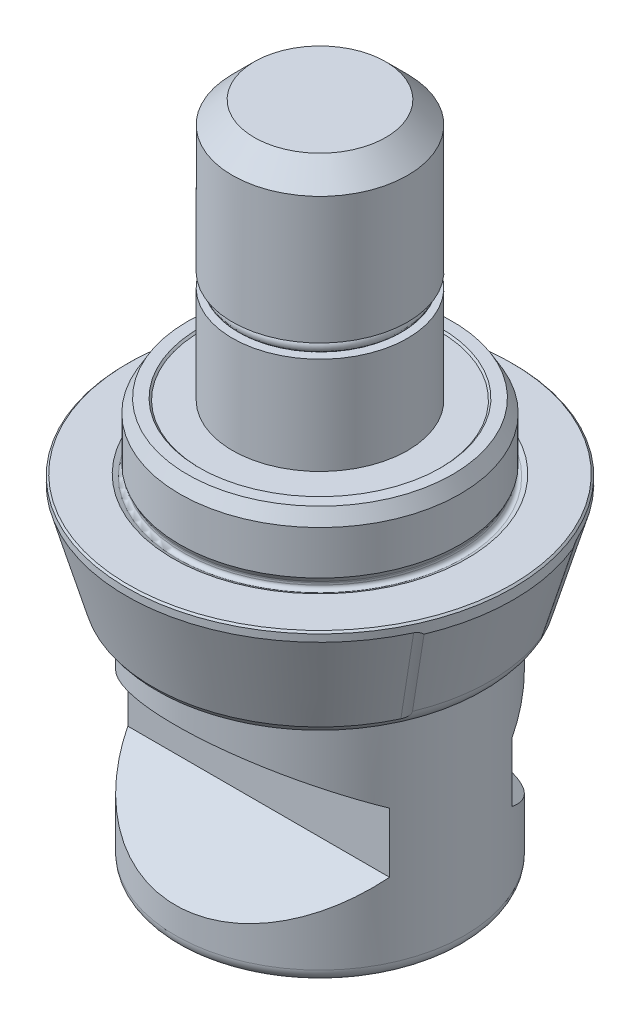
ISO-10303-21;
HEADER;
FILE_DESCRIPTION(('STEP AP214'),'2;1');
FILE_NAME('part.step','',(''),(''),'','','');
FILE_SCHEMA(('AUTOMOTIVE_DESIGN { 1 0 10303 214 1 1 1 1 }'));
ENDSEC;
DATA;
#1=APPLICATION_CONTEXT('core data for automotive mechanical design processes');
#2=APPLICATION_PROTOCOL_DEFINITION('international standard','automotive_design',2000,#1);
#3=PRODUCT_CONTEXT('',#1,'mechanical');
#4=PRODUCT('Part','Part','',(#3));
#5=PRODUCT_RELATED_PRODUCT_CATEGORY('part','',(#4));
#6=PRODUCT_DEFINITION_FORMATION('','',#4);
#7=PRODUCT_DEFINITION_CONTEXT('part definition',#1,'design');
#8=PRODUCT_DEFINITION('design','',#6,#7);
#9=PRODUCT_DEFINITION_SHAPE('','',#8);
#10=(LENGTH_UNIT() NAMED_UNIT(*) SI_UNIT(.MILLI.,.METRE.));
#11=(NAMED_UNIT(*) PLANE_ANGLE_UNIT() SI_UNIT($,.RADIAN.));
#12=(NAMED_UNIT(*) SI_UNIT($,.STERADIAN.) SOLID_ANGLE_UNIT());
#13=UNCERTAINTY_MEASURE_WITH_UNIT(LENGTH_MEASURE(1.E-05),#10,'distance_accuracy_value','');
#14=(GEOMETRIC_REPRESENTATION_CONTEXT(3) GLOBAL_UNCERTAINTY_ASSIGNED_CONTEXT((#13)) GLOBAL_UNIT_ASSIGNED_CONTEXT((#10,
#11,#12)) REPRESENTATION_CONTEXT('',''));
#15=CARTESIAN_POINT('',(0.,0.,0.));
#16=DIRECTION('',(0.,0.,1.));
#17=DIRECTION('',(1.,0.,0.));
#18=AXIS2_PLACEMENT_3D('',#15,#16,#17);
#19=CARTESIAN_POINT('',(0.,-13.,0.));
#20=DIRECTION('',(0.,1.,0.));
#21=DIRECTION('',(1.,0.,0.));
#22=AXIS2_PLACEMENT_3D('',#19,#20,#21);
#23=CONICAL_SURFACE('',#22,18.7723099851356,0.279252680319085);
#24=CARTESIAN_POINT('',(0.,-1.3949657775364,0.));
#25=DIRECTION('',(0.,-1.,0.));
#26=DIRECTION('',(-1.,0.,0.));
#27=AXIS2_PLACEMENT_3D('',#24,#25,#26);
#28=CIRCLE('',#27,22.1);
#29=CARTESIAN_POINT('',(20.3943726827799,-1.39496577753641,-8.51349298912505));
#30=VERTEX_POINT('',#29);
#31=CARTESIAN_POINT('',(20.3943726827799,-1.39496577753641,8.51349298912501));
#32=VERTEX_POINT('',#31);
#33=EDGE_CURVE('E567',#30,#32,#28,.T.);
#34=ORIENTED_EDGE('',*,*,#33,.T.);
#35=CARTESIAN_POINT('',(20.3944247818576,-1.3947657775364,8.51351705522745));
#36=CARTESIAN_POINT('',(19.818711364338,-3.6048860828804,8.24755369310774));
#37=CARTESIAN_POINT('',(19.242879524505,-5.81499633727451,7.98176343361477));
#38=CARTESIAN_POINT('',(18.4235278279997,-8.95910351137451,7.60389422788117));
#39=CARTESIAN_POINT('',(18.1801052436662,-9.89310868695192,7.49167309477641));
#40=CARTESIAN_POINT('',(17.9366615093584,-10.827112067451,7.37948287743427));
#41=B_SPLINE_CURVE_WITH_KNOTS('',3,(#35,#36,#37,#38,#39,#40),.UNSPECIFIED.,.F.,.F.,(4,2,4),(0.,
6.89792193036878,9.81304186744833),.UNSPECIFIED.);
#42=CARTESIAN_POINT('',(17.9367136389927,-10.8269120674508,7.37950690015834));
#43=VERTEX_POINT('',#42);
#44=EDGE_CURVE('E472',#32,#43,#41,.T.);
#45=ORIENTED_EDGE('',*,*,#44,.T.);
#46=CARTESIAN_POINT('',(0.,-10.826912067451,0.));
#47=DIRECTION('',(0.,-1.,0.));
#48=DIRECTION('',(-1.,0.,0.));
#49=AXIS2_PLACEMENT_3D('',#46,#47,#48);
#50=CIRCLE('',#49,19.3954329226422);
#51=CARTESIAN_POINT('',(17.9367136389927,-10.826912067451,-7.37950690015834));
#52=VERTEX_POINT('',#51);
#53=EDGE_CURVE('E355',#43,#52,#50,.F.);
#54=ORIENTED_EDGE('',*,*,#53,.T.);
#55=CARTESIAN_POINT('',(17.9366615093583,-10.827112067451,-7.37948287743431));
#56=CARTESIAN_POINT('',(18.3464058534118,-9.25506429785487,-7.56831744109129));
#57=CARTESIAN_POINT('',(18.7560916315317,-7.68301155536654,-7.75723757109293));
#58=CARTESIAN_POINT('',(19.5753460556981,-4.53889612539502,-8.13524896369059));
#59=CARTESIAN_POINT('',(19.9849147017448,-2.96683343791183,-8.32434022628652));
#60=CARTESIAN_POINT('',(20.3944247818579,-1.39476577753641,-8.51351705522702));
#61=B_SPLINE_CURVE_WITH_KNOTS('',3,(#55,#56,#57,#58,#59,#60),.UNSPECIFIED.,.F.,.F.,(4,2,4),(0.,
4.90652093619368,9.81304186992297),.UNSPECIFIED.);
#62=EDGE_CURVE('E491',#52,#30,#61,.T.);
#63=ORIENTED_EDGE('',*,*,#62,.T.);
#64=EDGE_LOOP('',(#34,#45,#54,#63));
#65=FACE_BOUND('',#64,.T.);
#66=ADVANCED_FACE('F16',(#65),#23,.T.);
#67=CARTESIAN_POINT('',(0.,0.,0.));
#68=DIRECTION('',(0.,-1.,0.));
#69=DIRECTION('',(-1.,0.,0.));
#70=AXIS2_PLACEMENT_3D('',#67,#68,#69);
#71=CYLINDRICAL_SURFACE('',#70,22.1);
#72=CARTESIAN_POINT('',(0.,-0.199999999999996,0.));
#73=DIRECTION('',(0.,1.,0.));
#74=DIRECTION('',(1.,0.,0.));
#75=AXIS2_PLACEMENT_3D('',#72,#73,#74);
#76=CIRCLE('',#75,22.1);
#77=CARTESIAN_POINT('',(22.1,-0.199999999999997,0.));
#78=VERTEX_POINT('',#77);
#79=EDGE_CURVE('E366',#78,#78,#76,.F.);
#80=ORIENTED_EDGE('',*,*,#79,.T.);
#81=EDGE_LOOP('',(#80));
#82=FACE_BOUND('',#81,.T.);
#83=CARTESIAN_POINT('',(0.,-1.03217024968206,0.));
#84=DIRECTION('',(0.,1.,0.));
#85=DIRECTION('',(1.,0.,0.));
#86=AXIS2_PLACEMENT_3D('',#83,#84,#85);
#87=CIRCLE('',#86,22.1);
#88=CARTESIAN_POINT('',(-20.02940209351,-1.03217024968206,9.3398635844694));
#89=VERTEX_POINT('',#88);
#90=CARTESIAN_POINT('',(20.02940209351,-1.03217024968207,9.3398635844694));
#91=VERTEX_POINT('',#90);
#92=EDGE_CURVE('E542',#89,#91,#87,.T.);
#93=ORIENTED_EDGE('',*,*,#92,.T.);
#94=CARTESIAN_POINT('',(19.6309640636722,-1.39496577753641,10.1506280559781));
#95=CARTESIAN_POINT('',(19.6586212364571,-1.34633121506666,10.097135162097));
#96=CARTESIAN_POINT('',(19.6872777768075,-1.30047984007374,10.0411826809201));
#97=CARTESIAN_POINT('',(19.7468664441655,-1.21648741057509,9.92349290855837));
#98=CARTESIAN_POINT('',(19.7778255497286,-1.17846784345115,9.86168347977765));
#99=CARTESIAN_POINT('',(19.8417490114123,-1.11358922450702,9.73243072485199));
#100=CARTESIAN_POINT('',(19.8747278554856,-1.08682524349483,9.66494496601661));
#101=CARTESIAN_POINT('',(19.9414159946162,-1.04841254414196,9.52658153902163));
#102=CARTESIAN_POINT('',(19.9751188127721,-1.03666246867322,9.45573000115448));
#103=CARTESIAN_POINT('',(20.0385044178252,-1.03017430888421,9.32058549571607));
#104=CARTESIAN_POINT('',(20.0682345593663,-1.0337645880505,9.25639363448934));
#105=CARTESIAN_POINT('',(20.1263777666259,-1.05374959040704,9.12928394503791));
#106=CARTESIAN_POINT('',(20.1547871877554,-1.07017774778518,9.06636988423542));
#107=CARTESIAN_POINT('',(20.2155925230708,-1.11879338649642,8.93009267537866));
#108=CARTESIAN_POINT('',(20.2474883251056,-1.15365492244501,8.8574800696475));
#109=CARTESIAN_POINT('',(20.307933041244,-1.23537421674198,8.71800848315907));
#110=CARTESIAN_POINT('',(20.3364795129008,-1.28224065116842,8.65115371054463));
#111=CARTESIAN_POINT('',(20.3740106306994,-1.35327733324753,8.5621500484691));
#112=CARTESIAN_POINT('',(20.3843048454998,-1.373850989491,8.53760965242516));
#113=CARTESIAN_POINT('',(20.3943726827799,-1.39496577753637,8.51349298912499));
#114=B_SPLINE_CURVE_WITH_KNOTS('',3,(#94,#95,#96,#97,#98,#99,#100,#101,#102,#103,#104,#105,#106,
#107,#108,#109,#110,#111,#112,#113),.UNSPECIFIED.,.F.,.F.,(4,2,2,2,2,2,2,2,2,4),(0.,
0.232597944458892,0.468569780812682,0.706496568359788,0.942808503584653,1.15406503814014,
1.36587359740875,1.62433285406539,1.8829794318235,1.98383460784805),.UNSPECIFIED.);
#115=EDGE_CURVE('E523',#91,#32,#114,.T.);
#116=ORIENTED_EDGE('',*,*,#115,.T.);
#117=ORIENTED_EDGE('',*,*,#33,.F.);
#118=CARTESIAN_POINT('',(20.3943726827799,-1.39496577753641,-8.51349298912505));
#119=CARTESIAN_POINT('',(20.371172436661,-1.34633121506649,-8.56906418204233));
#120=CARTESIAN_POINT('',(20.3467304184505,-1.30047984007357,-8.6269819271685));
#121=CARTESIAN_POINT('',(20.2948776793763,-1.21648741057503,-8.74827902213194));
#122=CARTESIAN_POINT('',(20.2674290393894,-1.17846784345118,-8.81172540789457));
#123=CARTESIAN_POINT('',(20.2095048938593,-1.113589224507,-8.94377568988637));
#124=CARTESIAN_POINT('',(20.1790061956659,-1.08682524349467,-9.01241795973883));
#125=CARTESIAN_POINT('',(20.1158799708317,-1.04841254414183,-9.15244233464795));
#126=CARTESIAN_POINT('',(20.0832682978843,-1.03666246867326,-9.223802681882));
#127=CARTESIAN_POINT('',(20.0204850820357,-1.03017430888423,-9.3592280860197));
#128=CARTESIAN_POINT('',(19.9904214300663,-1.03376458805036,-9.42326442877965));
#129=CARTESIAN_POINT('',(19.9304234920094,-1.0537495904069,-9.54950924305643));
#130=CARTESIAN_POINT('',(19.900489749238,-1.07017774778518,-9.61171250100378));
#131=CARTESIAN_POINT('',(19.8351802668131,-1.11879338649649,-9.74588939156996));
#132=CARTESIAN_POINT('',(19.8000580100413,-1.15365492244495,-9.81699747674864));
#133=CARTESIAN_POINT('',(19.7320696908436,-1.23537421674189,-9.95295142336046));
#134=CARTESIAN_POINT('',(19.6992052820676,-1.28224065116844,-10.0177927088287));
#135=CARTESIAN_POINT('',(19.6551490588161,-1.35327733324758,-10.1037536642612));
#136=CARTESIAN_POINT('',(19.6429670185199,-1.37385098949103,-10.1274137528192));
#137=CARTESIAN_POINT('',(19.6309640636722,-1.39496577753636,-10.1506280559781));
#138=B_SPLINE_CURVE_WITH_KNOTS('',3,(#118,#119,#120,#121,#122,#123,#124,#125,#126,#127,#128,
#129,#130,#131,#132,#133,#134,#135,#136,#137),.UNSPECIFIED.,.F.,.F.,(4,2,2,2,2,2,2,2,2,4),(0.,
0.232597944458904,0.468569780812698,0.70649656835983,0.942808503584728,1.15406503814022,
1.36587359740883,1.62433285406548,1.88297943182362,1.98383460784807),.UNSPECIFIED.);
#139=CARTESIAN_POINT('',(20.02940209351,-1.03217024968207,-9.3398635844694));
#140=VERTEX_POINT('',#139);
#141=EDGE_CURVE('E471',#30,#140,#138,.T.);
#142=ORIENTED_EDGE('',*,*,#141,.T.);
#143=CARTESIAN_POINT('',(0.,-1.03217024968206,0.));
#144=DIRECTION('',(0.,1.,0.));
#145=DIRECTION('',(1.,0.,0.));
#146=AXIS2_PLACEMENT_3D('',#143,#144,#145);
#147=CIRCLE('',#146,22.1);
#148=CARTESIAN_POINT('',(-20.02940209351,-1.03217024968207,-9.3398635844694));
#149=VERTEX_POINT('',#148);
#150=EDGE_CURVE('E547',#149,#140,#147,.F.);
#151=ORIENTED_EDGE('',*,*,#150,.F.);
#152=CARTESIAN_POINT('',(-19.6309640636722,-1.39496577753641,-10.1506280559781));
#153=CARTESIAN_POINT('',(-19.6586212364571,-1.3463312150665,-10.097135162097));
#154=CARTESIAN_POINT('',(-19.6872777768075,-1.30047984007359,-10.0411826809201));
#155=CARTESIAN_POINT('',(-19.7468664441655,-1.21648741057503,-9.92349290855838));
#156=CARTESIAN_POINT('',(-19.7778255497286,-1.17846784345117,-9.86168347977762));
#157=CARTESIAN_POINT('',(-19.8417490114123,-1.113589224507,-9.73243072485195));
#158=CARTESIAN_POINT('',(-19.8747278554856,-1.08682524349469,-9.6649449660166));
#159=CARTESIAN_POINT('',(-19.9414159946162,-1.04841254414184,-9.52658153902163));
#160=CARTESIAN_POINT('',(-19.9751188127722,-1.03666246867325,-9.45573000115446));
#161=CARTESIAN_POINT('',(-20.0385044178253,-1.03017430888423,-9.32058549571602));
#162=CARTESIAN_POINT('',(-20.0682345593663,-1.03376458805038,-9.25639363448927));
#163=CARTESIAN_POINT('',(-20.1263777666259,-1.05374959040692,-9.12928394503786));
#164=CARTESIAN_POINT('',(-20.1547871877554,-1.07017774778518,-9.0663698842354));
#165=CARTESIAN_POINT('',(-20.2155925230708,-1.11879338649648,-8.93009267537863));
#166=CARTESIAN_POINT('',(-20.2474883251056,-1.15365492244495,-8.85748006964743));
#167=CARTESIAN_POINT('',(-20.3079330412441,-1.2353742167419,-8.71800848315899));
#168=CARTESIAN_POINT('',(-20.3364795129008,-1.28224065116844,-8.65115371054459));
#169=CARTESIAN_POINT('',(-20.3740106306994,-1.35327733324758,-8.5621500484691));
#170=CARTESIAN_POINT('',(-20.3843048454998,-1.37385098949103,-8.53760965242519));
#171=CARTESIAN_POINT('',(-20.3943726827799,-1.39496577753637,-8.51349298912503));
#172=B_SPLINE_CURVE_WITH_KNOTS('',3,(#152,#153,#154,#155,#156,#157,#158,#159,#160,#161,#162,
#163,#164,#165,#166,#167,#168,#169,#170,#171),.UNSPECIFIED.,.F.,.F.,(4,2,2,2,2,2,2,2,2,4),(0.,
0.232597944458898,0.468569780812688,0.706496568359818,0.942808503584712,1.1540650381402,
1.3658735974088,1.62433285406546,1.88297943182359,1.98383460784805),.UNSPECIFIED.);
#173=CARTESIAN_POINT('',(-20.3943726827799,-1.3949657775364,-8.51349298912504));
#174=VERTEX_POINT('',#173);
#175=EDGE_CURVE('E32',#149,#174,#172,.T.);
#176=ORIENTED_EDGE('',*,*,#175,.T.);
#177=CARTESIAN_POINT('',(-20.3943726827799,-1.3949657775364,8.51349298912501));
#178=VERTEX_POINT('',#177);
#179=EDGE_CURVE('E566',#178,#174,#28,.T.);
#180=ORIENTED_EDGE('',*,*,#179,.F.);
#181=CARTESIAN_POINT('',(-20.3943726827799,-1.39496577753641,8.51349298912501));
#182=CARTESIAN_POINT('',(-20.371172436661,-1.34633121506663,8.56906418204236));
#183=CARTESIAN_POINT('',(-20.3467304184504,-1.3004798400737,8.62698192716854));
#184=CARTESIAN_POINT('',(-20.2948776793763,-1.21648741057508,8.74827902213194));
#185=CARTESIAN_POINT('',(-20.2674290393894,-1.17846784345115,8.81172540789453));
#186=CARTESIAN_POINT('',(-20.2095048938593,-1.11358922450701,8.94377568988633));
#187=CARTESIAN_POINT('',(-20.1790061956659,-1.0868252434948,9.01241795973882));
#188=CARTESIAN_POINT('',(-20.1158799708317,-1.04841254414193,9.15244233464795));
#189=CARTESIAN_POINT('',(-20.0832682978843,-1.03666246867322,9.22380268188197));
#190=CARTESIAN_POINT('',(-20.0204850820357,-1.03017430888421,9.35922808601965));
#191=CARTESIAN_POINT('',(-19.9904214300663,-1.03376458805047,9.4232644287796));
#192=CARTESIAN_POINT('',(-19.9304234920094,-1.053749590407,9.5495092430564));
#193=CARTESIAN_POINT('',(-19.900489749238,-1.07017774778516,9.61171250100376));
#194=CARTESIAN_POINT('',(-19.8351802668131,-1.11879338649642,9.74588939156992));
#195=CARTESIAN_POINT('',(-19.8000580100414,-1.15365492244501,9.81699747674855));
#196=CARTESIAN_POINT('',(-19.7320696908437,-1.23537421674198,9.95295142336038));
#197=CARTESIAN_POINT('',(-19.6992052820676,-1.28224065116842,10.0177927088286));
#198=CARTESIAN_POINT('',(-19.6551490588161,-1.35327733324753,10.1037536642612));
#199=CARTESIAN_POINT('',(-19.6429670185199,-1.37385098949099,10.1274137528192));
#200=CARTESIAN_POINT('',(-19.6309640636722,-1.39496577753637,10.1506280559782));
#201=B_SPLINE_CURVE_WITH_KNOTS('',3,(#181,#182,#183,#184,#185,#186,#187,#188,#189,#190,#191,
#192,#193,#194,#195,#196,#197,#198,#199,#200),.UNSPECIFIED.,.F.,.F.,(4,2,2,2,2,2,2,2,2,4),(0.,
0.232597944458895,0.468569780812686,0.706496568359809,0.942808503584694,1.15406503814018,
1.36587359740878,1.62433285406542,1.88297943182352,1.98383460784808),.UNSPECIFIED.);
#202=EDGE_CURVE('E503',#178,#89,#201,.T.);
#203=ORIENTED_EDGE('',*,*,#202,.T.);
#204=EDGE_LOOP('',(#93,#116,#117,#142,#151,#176,#180,#203));
#205=FACE_BOUND('',#204,.T.);
#206=ADVANCED_FACE('F318',(#82,#205),#71,.T.);
#207=CARTESIAN_POINT('',(0.,-10.,0.));
#208=DIRECTION('',(0.,-1.,0.));
#209=DIRECTION('',(-1.,0.,0.));
#210=AXIS2_PLACEMENT_3D('',#207,#208,#209);
#211=TOROIDAL_SURFACE('',#210,16.5116478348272,3.);
#212=CARTESIAN_POINT('',(0.,-13.,0.));
#213=DIRECTION('',(0.,-1.,0.));
#214=DIRECTION('',(-1.,0.,0.));
#215=AXIS2_PLACEMENT_3D('',#212,#213,#214);
#216=CIRCLE('',#215,16.5116478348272);
#217=CARTESIAN_POINT('',(-16.5116478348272,-13.,0.));
#218=VERTEX_POINT('',#217);
#219=EDGE_CURVE('E360',#218,#218,#216,.T.);
#220=ORIENTED_EDGE('',*,*,#219,.F.);
#221=EDGE_LOOP('',(#220));
#222=FACE_BOUND('',#221,.T.);
#223=ORIENTED_EDGE('',*,*,#53,.F.);
#224=CARTESIAN_POINT('',(17.9367657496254,-10.826712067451,7.37953094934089));
#225=CARTESIAN_POINT('',(17.9260413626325,-10.8681473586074,7.37448321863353));
#226=CARTESIAN_POINT('',(17.912814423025,-10.9092972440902,7.37298862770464));
#227=CARTESIAN_POINT('',(17.8822708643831,-10.9894585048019,7.37685378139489));
#228=CARTESIAN_POINT('',(17.8649776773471,-11.0284806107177,7.3821750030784));
#229=CARTESIAN_POINT('',(17.8270927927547,-11.1032850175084,7.39936177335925));
#230=CARTESIAN_POINT('',(17.8065037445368,-11.1390698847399,7.41122208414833));
#231=CARTESIAN_POINT('',(17.7630486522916,-11.2065689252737,7.44088594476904));
#232=CARTESIAN_POINT('',(17.7401808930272,-11.2382799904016,7.45869399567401));
#233=CARTESIAN_POINT('',(17.6942723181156,-11.2957275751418,7.49857981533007));
#234=CARTESIAN_POINT('',(17.6712862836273,-11.3216696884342,7.52042758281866));
#235=CARTESIAN_POINT('',(17.6249804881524,-11.3691284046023,7.56816951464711));
#236=CARTESIAN_POINT('',(17.6016606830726,-11.3906444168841,7.59406421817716));
#237=CARTESIAN_POINT('',(17.5520688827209,-11.4319505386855,7.65315662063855));
#238=CARTESIAN_POINT('',(17.5258471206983,-11.4510633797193,7.68686921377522));
#239=CARTESIAN_POINT('',(17.4746306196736,-11.4835576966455,7.75780102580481));
#240=CARTESIAN_POINT('',(17.4496366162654,-11.4969357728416,7.79502230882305));
#241=CARTESIAN_POINT('',(17.3980217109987,-11.5196052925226,7.8777057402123));
#242=CARTESIAN_POINT('',(17.3716840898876,-11.5280318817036,7.92358307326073));
#243=CARTESIAN_POINT('',(17.3221135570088,-11.5376846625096,8.01772265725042));
#244=CARTESIAN_POINT('',(17.2988824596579,-11.5389066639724,8.0659862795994));
#245=CARTESIAN_POINT('',(17.2540974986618,-11.5339457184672,8.16829973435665));
#246=CARTESIAN_POINT('',(17.2328960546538,-11.527069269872,8.22247261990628));
#247=CARTESIAN_POINT('',(17.1954335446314,-11.5045863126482,8.33076831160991));
#248=CARTESIAN_POINT('',(17.1791746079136,-11.4889760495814,8.38489108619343));
#249=CARTESIAN_POINT('',(17.1523329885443,-11.4491378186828,8.4902058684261));
#250=CARTESIAN_POINT('',(17.1416531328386,-11.4250705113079,8.54143314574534));
#251=CARTESIAN_POINT('',(17.1258955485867,-11.3681395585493,8.63966746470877));
#252=CARTESIAN_POINT('',(17.1208062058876,-11.3352943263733,8.68668306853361));
#253=CARTESIAN_POINT('',(17.1169503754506,-11.2713027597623,8.76185338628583));
#254=CARTESIAN_POINT('',(17.1168346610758,-11.2421515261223,8.79164847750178));
#255=CARTESIAN_POINT('',(17.1195647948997,-11.1797473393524,8.84646221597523));
#256=CARTESIAN_POINT('',(17.1224099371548,-11.1464953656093,8.87148200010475));
#257=CARTESIAN_POINT('',(17.1309367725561,-11.0764013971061,8.91573408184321));
#258=CARTESIAN_POINT('',(17.1366334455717,-11.0395412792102,8.93493494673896));
#259=CARTESIAN_POINT('',(17.1506015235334,-10.963475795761,8.96637582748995));
#260=CARTESIAN_POINT('',(17.158867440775,-10.9242755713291,8.97863052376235));
#261=CARTESIAN_POINT('',(17.1727660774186,-10.8653787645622,8.9912844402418));
#262=CARTESIAN_POINT('',(17.1775544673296,-10.8460634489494,8.9945379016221));
#263=CARTESIAN_POINT('',(17.182579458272,-10.8267120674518,8.99688867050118));
#264=B_SPLINE_CURVE_WITH_KNOTS('',3,(#224,#225,#226,#227,#228,#229,#230,#231,#232,#233,#234,
#235,#236,#237,#238,#239,#240,#241,#242,#243,#244,#245,#246,#247,#248,#249,#250,#251,#252,#253,
#254,#255,#256,#257,#258,#259,#260,#261,#262,#263),.UNSPECIFIED.,.F.,.F.,(4,2,2,2,2,2,2,2,2,2,2,
2,2,2,2,2,2,2,2,4),(0.,0.128987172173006,0.25724851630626,0.38540727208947,0.513663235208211,
0.636108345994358,0.758569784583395,0.89839481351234,1.03830261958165,1.19833902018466,
1.35846848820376,1.53336981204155,1.70834637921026,1.8801641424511,2.05162427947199,
2.17616001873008,2.30066607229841,2.42583316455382,2.5507347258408,2.61114030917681),.UNSPECIFIED.);
#265=CARTESIAN_POINT('',(17.2992275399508,-11.5377074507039,8.06676228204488));
#266=VERTEX_POINT('',#265);
#267=EDGE_CURVE('E240',#43,#266,#264,.T.);
#268=ORIENTED_EDGE('',*,*,#267,.T.);
#269=CARTESIAN_POINT('',(0.,-11.5377074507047,0.));
#270=DIRECTION('',(0.,1.,0.));
#271=DIRECTION('',(1.,0.,0.));
#272=AXIS2_PLACEMENT_3D('',#269,#270,#271);
#273=CIRCLE('',#272,19.0875856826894);
#274=CARTESIAN_POINT('',(-17.2992275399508,-11.5377074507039,8.06676228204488));
#275=VERTEX_POINT('',#274);
#276=EDGE_CURVE('E375',#266,#275,#273,.F.);
#277=ORIENTED_EDGE('',*,*,#276,.T.);
#278=CARTESIAN_POINT('',(-17.1825794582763,-10.826712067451,8.99688867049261));
#279=CARTESIAN_POINT('',(-17.171819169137,-10.8681473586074,8.99191793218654));
#280=CARTESIAN_POINT('',(-17.1621721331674,-10.9092972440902,8.98274621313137));
#281=CARTESIAN_POINT('',(-17.1454999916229,-10.9894585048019,8.95686401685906));
#282=CARTESIAN_POINT('',(-17.1384604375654,-11.0284806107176,8.94019625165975));
#283=CARTESIAN_POINT('',(-17.1272743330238,-11.1032850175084,8.90012730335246));
#284=CARTESIAN_POINT('',(-17.1231254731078,-11.1390698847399,8.87673151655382));
#285=CARTESIAN_POINT('',(-17.1179169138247,-11.2065689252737,8.8243754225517));
#286=CARTESIAN_POINT('',(-17.1168595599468,-11.2382799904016,8.79541090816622));
#287=CARTESIAN_POINT('',(-17.117904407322,-11.2957275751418,8.73460478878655));
#288=CARTESIAN_POINT('',(-17.1198656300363,-11.3216696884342,8.70295299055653));
#289=CARTESIAN_POINT('',(-17.1266732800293,-11.3691284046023,8.63679277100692));
#290=CARTESIAN_POINT('',(-17.1315200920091,-11.3906444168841,8.60228396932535));
#291=CARTESIAN_POINT('',(-17.1449105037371,-11.4319505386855,8.52631058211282));
#292=CARTESIAN_POINT('',(-17.1538808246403,-11.4510633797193,8.48455350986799));
#293=CARTESIAN_POINT('',(-17.1752964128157,-11.4835576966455,8.39972530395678));
#294=CARTESIAN_POINT('',(-17.1877437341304,-11.4969357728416,8.35665340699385));
#295=CARTESIAN_POINT('',(-17.2179054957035,-11.5196052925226,8.26396621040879));
#296=CARTESIAN_POINT('',(-17.2361200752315,-11.5280318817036,8.21430104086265));
#297=CARTESIAN_POINT('',(-17.2763718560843,-11.5376846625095,8.1158160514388));
#298=CARTESIAN_POINT('',(-17.298411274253,-11.5389066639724,8.06699673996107));
#299=CARTESIAN_POINT('',(-17.3480007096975,-11.5339457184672,7.96692364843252));
#300=CARTESIAN_POINT('',(-17.3758715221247,-11.527069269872,7.91586074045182));
#301=CARTESIAN_POINT('',(-17.4347503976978,-11.5045863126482,7.81755166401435));
#302=CARTESIAN_POINT('',(-17.4657598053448,-11.4889760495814,7.77030714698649));
#303=CARTESIAN_POINT('',(-17.5291821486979,-11.4491378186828,7.68205023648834));
#304=CARTESIAN_POINT('',(-17.5615596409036,-11.4250705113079,7.64094073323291));
#305=CARTESIAN_POINT('',(-17.6266827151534,-11.3681395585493,7.56572592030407));
#306=CARTESIAN_POINT('',(-17.6594273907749,-11.3352943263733,7.53160621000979));
#307=CARTESIAN_POINT('',(-17.7145327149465,-11.2713027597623,7.48033392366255));
#308=CARTESIAN_POINT('',(-17.7372826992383,-11.2421515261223,7.46109336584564));
#309=CARTESIAN_POINT('',(-17.7810273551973,-11.1797473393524,7.42795117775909));
#310=CARTESIAN_POINT('',(-17.8020224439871,-11.1464953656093,7.41404827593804));
#311=CARTESIAN_POINT('',(-17.8414024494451,-11.0764013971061,7.39213552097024));
#312=CARTESIAN_POINT('',(-17.8597729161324,-11.0395412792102,7.38415734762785));
#313=CARTESIAN_POINT('',(-17.8928365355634,-10.963475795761,7.37464770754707));
#314=CARTESIAN_POINT('',(-17.9075374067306,-10.9242755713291,7.37310260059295));
#315=CARTESIAN_POINT('',(-17.9261647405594,-10.8653787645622,7.37561579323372));
#316=CARTESIAN_POINT('',(-17.9317349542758,-10.8460634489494,7.37719262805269));
#317=CARTESIAN_POINT('',(-17.9367657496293,-10.8267120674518,7.37953094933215));
#318=B_SPLINE_CURVE_WITH_KNOTS('',3,(#278,#279,#280,#281,#282,#283,#284,#285,#286,#287,#288,
#289,#290,#291,#292,#293,#294,#295,#296,#297,#298,#299,#300,#301,#302,#303,#304,#305,#306,#307,
#308,#309,#310,#311,#312,#313,#314,#315,#316,#317),.UNSPECIFIED.,.F.,.F.,(4,2,2,2,2,2,2,2,2,2,2,
2,2,2,2,2,2,2,2,4),(0.,0.128987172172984,0.257248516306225,0.385407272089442,0.513663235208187,
0.636108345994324,0.758569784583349,0.898394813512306,1.03830261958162,1.19833902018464,
1.35846848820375,1.53336981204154,1.70834637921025,1.88016414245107,2.05162427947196,
2.17616001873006,2.3006660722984,2.42583316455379,2.55073472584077,2.6111403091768),.UNSPECIFIED.);
#319=CARTESIAN_POINT('',(-17.9367136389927,-10.826912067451,7.37950690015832));
#320=VERTEX_POINT('',#319);
#321=EDGE_CURVE('E40',#275,#320,#318,.T.);
#322=ORIENTED_EDGE('',*,*,#321,.T.);
#323=CARTESIAN_POINT('',(-17.9367136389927,-10.8269120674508,-7.37950690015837));
#324=VERTEX_POINT('',#323);
#325=EDGE_CURVE('E348',#324,#320,#50,.F.);
#326=ORIENTED_EDGE('',*,*,#325,.F.);
#327=CARTESIAN_POINT('',(-17.9367657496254,-10.826712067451,-7.37953094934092));
#328=CARTESIAN_POINT('',(-17.9260413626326,-10.8681473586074,-7.37448321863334));
#329=CARTESIAN_POINT('',(-17.912814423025,-10.9092972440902,-7.37298862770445));
#330=CARTESIAN_POINT('',(-17.8822708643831,-10.9894585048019,-7.37685378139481));
#331=CARTESIAN_POINT('',(-17.8649776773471,-11.0284806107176,-7.38217500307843));
#332=CARTESIAN_POINT('',(-17.8270927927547,-11.1032850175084,-7.39936177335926));
#333=CARTESIAN_POINT('',(-17.8065037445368,-11.13906988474,-7.41122208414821));
#334=CARTESIAN_POINT('',(-17.7630486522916,-11.2065689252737,-7.44088594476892));
#335=CARTESIAN_POINT('',(-17.7401808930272,-11.2382799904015,-7.45869399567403));
#336=CARTESIAN_POINT('',(-17.6942723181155,-11.2957275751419,-7.4985798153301));
#337=CARTESIAN_POINT('',(-17.6712862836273,-11.3216696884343,-7.52042758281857));
#338=CARTESIAN_POINT('',(-17.6249804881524,-11.3691284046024,-7.56816951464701));
#339=CARTESIAN_POINT('',(-17.6016606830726,-11.3906444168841,-7.59406421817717));
#340=CARTESIAN_POINT('',(-17.5520688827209,-11.4319505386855,-7.65315662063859));
#341=CARTESIAN_POINT('',(-17.5258471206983,-11.4510633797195,-7.68686921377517));
#342=CARTESIAN_POINT('',(-17.4746306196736,-11.4835576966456,-7.75780102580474));
#343=CARTESIAN_POINT('',(-17.4496366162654,-11.4969357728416,-7.79502230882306));
#344=CARTESIAN_POINT('',(-17.3980217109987,-11.5196052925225,-7.87770574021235));
#345=CARTESIAN_POINT('',(-17.3716840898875,-11.5280318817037,-7.92358307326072));
#346=CARTESIAN_POINT('',(-17.3221135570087,-11.5376846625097,-8.01772265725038));
#347=CARTESIAN_POINT('',(-17.2988824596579,-11.5389066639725,-8.0659862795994));
#348=CARTESIAN_POINT('',(-17.2540974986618,-11.5339457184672,-8.16829973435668));
#349=CARTESIAN_POINT('',(-17.2328960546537,-11.5270692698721,-8.2224726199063));
#350=CARTESIAN_POINT('',(-17.1954335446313,-11.5045863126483,-8.33076831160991));
#351=CARTESIAN_POINT('',(-17.1791746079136,-11.4889760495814,-8.38489108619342));
#352=CARTESIAN_POINT('',(-17.1523329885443,-11.4491378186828,-8.49020586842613));
#353=CARTESIAN_POINT('',(-17.1416531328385,-11.425070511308,-8.54143314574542));
#354=CARTESIAN_POINT('',(-17.1258955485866,-11.3681395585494,-8.63966746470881));
#355=CARTESIAN_POINT('',(-17.1208062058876,-11.3352943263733,-8.68668306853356));
#356=CARTESIAN_POINT('',(-17.1169503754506,-11.2713027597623,-8.76185338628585));
#357=CARTESIAN_POINT('',(-17.1168346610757,-11.2421515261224,-8.79164847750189));
#358=CARTESIAN_POINT('',(-17.1195647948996,-11.1797473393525,-8.84646221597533));
#359=CARTESIAN_POINT('',(-17.1224099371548,-11.1464953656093,-8.87148200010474));
#360=CARTESIAN_POINT('',(-17.1309367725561,-11.0764013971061,-8.91573408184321));
#361=CARTESIAN_POINT('',(-17.1366334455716,-11.0395412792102,-8.93493494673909));
#362=CARTESIAN_POINT('',(-17.1506015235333,-10.963475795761,-8.96637582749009));
#363=CARTESIAN_POINT('',(-17.158867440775,-10.9242755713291,-8.97863052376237));
#364=CARTESIAN_POINT('',(-17.1727660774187,-10.8653787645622,-8.99128444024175));
#365=CARTESIAN_POINT('',(-17.1775544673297,-10.8460634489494,-8.99453790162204));
#366=CARTESIAN_POINT('',(-17.182579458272,-10.8267120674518,-8.99688867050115));
#367=B_SPLINE_CURVE_WITH_KNOTS('',3,(#327,#328,#329,#330,#331,#332,#333,#334,#335,#336,#337,
#338,#339,#340,#341,#342,#343,#344,#345,#346,#347,#348,#349,#350,#351,#352,#353,#354,#355,#356,
#357,#358,#359,#360,#361,#362,#363,#364,#365,#366),.UNSPECIFIED.,.F.,.F.,(4,2,2,2,2,2,2,2,2,2,2,
2,2,2,2,2,2,2,2,4),(0.,0.128987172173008,0.257248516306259,0.385407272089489,0.513663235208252,
0.63610834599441,0.758569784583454,0.898394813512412,1.03830261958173,1.19833902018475,
1.35846848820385,1.53336981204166,1.70834637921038,1.88016414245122,2.05162427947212,
2.17616001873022,2.30066607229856,2.42583316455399,2.550734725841,2.61114030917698),.UNSPECIFIED.);
#368=CARTESIAN_POINT('',(-17.2992275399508,-11.5377074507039,-8.06676228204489));
#369=VERTEX_POINT('',#368);
#370=EDGE_CURVE('E444',#324,#369,#367,.T.);
#371=ORIENTED_EDGE('',*,*,#370,.T.);
#372=CARTESIAN_POINT('',(0.,-11.5377074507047,0.));
#373=DIRECTION('',(0.,1.,0.));
#374=DIRECTION('',(1.,0.,0.));
#375=AXIS2_PLACEMENT_3D('',#372,#373,#374);
#376=CIRCLE('',#375,19.0875856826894);
#377=CARTESIAN_POINT('',(17.2992275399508,-11.5377074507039,-8.06676228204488));
#378=VERTEX_POINT('',#377);
#379=EDGE_CURVE('E372',#378,#369,#376,.T.);
#380=ORIENTED_EDGE('',*,*,#379,.F.);
#381=CARTESIAN_POINT('',(17.1825794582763,-10.826712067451,-8.99688867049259));
#382=CARTESIAN_POINT('',(17.1718191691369,-10.8681473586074,-8.99191793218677));
#383=CARTESIAN_POINT('',(17.1621721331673,-10.9092972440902,-8.98274621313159));
#384=CARTESIAN_POINT('',(17.1454999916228,-10.9894585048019,-8.95686401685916));
#385=CARTESIAN_POINT('',(17.1384604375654,-11.0284806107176,-8.94019625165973));
#386=CARTESIAN_POINT('',(17.1272743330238,-11.1032850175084,-8.90012730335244));
#387=CARTESIAN_POINT('',(17.1231254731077,-11.13906988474,-8.87673151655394));
#388=CARTESIAN_POINT('',(17.1179169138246,-11.2065689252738,-8.82437542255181));
#389=CARTESIAN_POINT('',(17.1168595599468,-11.2382799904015,-8.7954109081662));
#390=CARTESIAN_POINT('',(17.117904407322,-11.2957275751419,-8.7346047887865));
#391=CARTESIAN_POINT('',(17.1198656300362,-11.3216696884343,-8.70295299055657));
#392=CARTESIAN_POINT('',(17.1266732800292,-11.3691284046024,-8.63679277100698));
#393=CARTESIAN_POINT('',(17.1315200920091,-11.3906444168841,-8.60228396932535));
#394=CARTESIAN_POINT('',(17.1449105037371,-11.4319505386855,-8.52631058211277));
#395=CARTESIAN_POINT('',(17.1538808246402,-11.4510633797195,-8.48455350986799));
#396=CARTESIAN_POINT('',(17.1752964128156,-11.4835576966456,-8.3997253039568));
#397=CARTESIAN_POINT('',(17.1877437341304,-11.4969357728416,-8.35665340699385));
#398=CARTESIAN_POINT('',(17.2179054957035,-11.5196052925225,-8.26396621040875));
#399=CARTESIAN_POINT('',(17.2361200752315,-11.5280318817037,-8.21430104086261));
#400=CARTESIAN_POINT('',(17.2763718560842,-11.5376846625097,-8.11581605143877));
#401=CARTESIAN_POINT('',(17.298411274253,-11.5389066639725,-8.06699673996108));
#402=CARTESIAN_POINT('',(17.3480007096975,-11.5339457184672,-7.9669236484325));
#403=CARTESIAN_POINT('',(17.3758715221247,-11.5270692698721,-7.91586074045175));
#404=CARTESIAN_POINT('',(17.4347503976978,-11.5045863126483,-7.8175516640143));
#405=CARTESIAN_POINT('',(17.4657598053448,-11.4889760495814,-7.77030714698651));
#406=CARTESIAN_POINT('',(17.529182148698,-11.4491378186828,-7.68205023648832));
#407=CARTESIAN_POINT('',(17.5615596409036,-11.425070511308,-7.64094073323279));
#408=CARTESIAN_POINT('',(17.6266827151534,-11.3681395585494,-7.56572592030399));
#409=CARTESIAN_POINT('',(17.6594273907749,-11.3352943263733,-7.53160621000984));
#410=CARTESIAN_POINT('',(17.7145327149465,-11.2713027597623,-7.48033392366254));
#411=CARTESIAN_POINT('',(17.7372826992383,-11.2421515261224,-7.4610933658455));
#412=CARTESIAN_POINT('',(17.7810273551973,-11.1797473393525,-7.42795117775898));
#413=CARTESIAN_POINT('',(17.8020224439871,-11.1464953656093,-7.41404827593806));
#414=CARTESIAN_POINT('',(17.8414024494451,-11.0764013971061,-7.39213552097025));
#415=CARTESIAN_POINT('',(17.8597729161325,-11.0395412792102,-7.38415734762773));
#416=CARTESIAN_POINT('',(17.8928365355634,-10.9634757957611,-7.37464770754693));
#417=CARTESIAN_POINT('',(17.9075374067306,-10.9242755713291,-7.37310260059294));
#418=CARTESIAN_POINT('',(17.9261647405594,-10.8653787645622,-7.37561579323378));
#419=CARTESIAN_POINT('',(17.9317349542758,-10.8460634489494,-7.37719262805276));
#420=CARTESIAN_POINT('',(17.9367657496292,-10.8267120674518,-7.37953094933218));
#421=B_SPLINE_CURVE_WITH_KNOTS('',3,(#381,#382,#383,#384,#385,#386,#387,#388,#389,#390,#391,
#392,#393,#394,#395,#396,#397,#398,#399,#400,#401,#402,#403,#404,#405,#406,#407,#408,#409,#410,
#411,#412,#413,#414,#415,#416,#417,#418,#419,#420),.UNSPECIFIED.,.F.,.F.,(4,2,2,2,2,2,2,2,2,2,2,
2,2,2,2,2,2,2,2,4),(0.,0.128987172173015,0.257248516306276,0.385407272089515,0.513663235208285,
0.636108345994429,0.758569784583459,0.898394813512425,1.03830261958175,1.19833902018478,
1.35846848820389,1.53336981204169,1.70834637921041,1.88016414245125,2.05162427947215,
2.17616001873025,2.3006660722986,2.42583316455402,2.55073472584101,2.61114030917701),.UNSPECIFIED.);
#422=EDGE_CURVE('E462',#378,#52,#421,.T.);
#423=ORIENTED_EDGE('',*,*,#422,.T.);
#424=EDGE_LOOP('',(#223,#268,#277,#322,#326,#371,#380,#423));
#425=FACE_BOUND('',#424,.T.);
#426=ADVANCED_FACE('F327',(#222,#425),#211,.T.);
#427=ORIENTED_EDGE('',*,*,#325,.T.);
#428=CARTESIAN_POINT('',(-17.9366615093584,-10.827112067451,7.37948287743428));
#429=CARTESIAN_POINT('',(-18.3464058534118,-9.25506429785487,7.56831744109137));
#430=CARTESIAN_POINT('',(-18.7560916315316,-7.68301155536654,7.75723757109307));
#431=CARTESIAN_POINT('',(-19.5753460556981,-4.53889612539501,8.13524896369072));
#432=CARTESIAN_POINT('',(-19.9849147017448,-2.96683343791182,8.3243402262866));
#433=CARTESIAN_POINT('',(-20.3944247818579,-1.39476577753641,8.51351705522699));
#434=B_SPLINE_CURVE_WITH_KNOTS('',3,(#428,#429,#430,#431,#432,#433),.UNSPECIFIED.,.F.,.F.,(4,2,
4),(0.,4.90652093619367,9.81304186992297),.UNSPECIFIED.);
#435=EDGE_CURVE('E349',#320,#178,#434,.T.);
#436=ORIENTED_EDGE('',*,*,#435,.T.);
#437=ORIENTED_EDGE('',*,*,#179,.T.);
#438=CARTESIAN_POINT('',(-20.3944247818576,-1.3947657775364,-8.51351705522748));
#439=CARTESIAN_POINT('',(-19.818711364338,-3.60488608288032,-8.24755369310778));
#440=CARTESIAN_POINT('',(-19.2428795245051,-5.81499633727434,-7.98176343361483));
#441=CARTESIAN_POINT('',(-18.4235278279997,-8.95910351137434,-7.60389422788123));
#442=CARTESIAN_POINT('',(-18.1801052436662,-9.89310868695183,-7.49167309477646));
#443=CARTESIAN_POINT('',(-17.9366615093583,-10.827112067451,-7.37948287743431));
#444=B_SPLINE_CURVE_WITH_KNOTS('',3,(#438,#439,#440,#441,#442,#443),.UNSPECIFIED.,.F.,.F.,(4,2,
4),(0.,6.89792193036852,9.81304186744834),.UNSPECIFIED.);
#445=EDGE_CURVE('E351',#174,#324,#444,.T.);
#446=ORIENTED_EDGE('',*,*,#445,.T.);
#447=EDGE_LOOP('',(#427,#436,#437,#446));
#448=FACE_BOUND('',#447,.T.);
#449=ADVANCED_FACE('F321',(#448),#23,.T.);
#450=CARTESIAN_POINT('',(0.,0.,0.));
#451=DIRECTION('',(0.,-1.,0.));
#452=DIRECTION('',(-1.,0.,0.));
#453=AXIS2_PLACEMENT_3D('',#450,#451,#452);
#454=CYLINDRICAL_SURFACE('',#453,16.);
#455=CARTESIAN_POINT('',(0.,1.,0.));
#456=DIRECTION('',(0.,-1.,0.));
#457=DIRECTION('',(-1.,0.,0.));
#458=AXIS2_PLACEMENT_3D('',#455,#456,#457);
#459=CIRCLE('',#458,16.);
#460=CARTESIAN_POINT('',(-16.,1.,0.));
#461=VERTEX_POINT('',#460);
#462=EDGE_CURVE('E564',#461,#461,#459,.T.);
#463=ORIENTED_EDGE('',*,*,#462,.F.);
#464=EDGE_LOOP('',(#463));
#465=FACE_BOUND('',#464,.T.);
#466=CARTESIAN_POINT('',(0.,6.,0.));
#467=DIRECTION('',(0.,1.,0.));
#468=DIRECTION('',(1.,0.,0.));
#469=AXIS2_PLACEMENT_3D('',#466,#467,#468);
#470=CIRCLE('',#469,16.);
#471=CARTESIAN_POINT('',(16.,6.,0.));
#472=VERTEX_POINT('',#471);
#473=EDGE_CURVE('E354',#472,#472,#470,.F.);
#474=ORIENTED_EDGE('',*,*,#473,.T.);
#475=EDGE_LOOP('',(#474));
#476=FACE_BOUND('',#475,.T.);
#477=ADVANCED_FACE('F334',(#465,#476),#454,.T.);
#478=CARTESIAN_POINT('',(0.,0.,-16.));
#479=DIRECTION('',(0.,1.,0.));
#480=DIRECTION('',(1.,0.,0.));
#481=AXIS2_PLACEMENT_3D('',#478,#479,#480);
#482=PLANE('',#481);
#483=CARTESIAN_POINT('',(0.,0.,0.));
#484=DIRECTION('',(0.,-1.,0.));
#485=DIRECTION('',(-1.,0.,0.));
#486=AXIS2_PLACEMENT_3D('',#483,#484,#485);
#487=CIRCLE('',#486,16.774174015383);
#488=CARTESIAN_POINT('',(-16.774174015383,0.,0.));
#489=VERTEX_POINT('',#488);
#490=EDGE_CURVE('E549',#489,#489,#487,.T.);
#491=ORIENTED_EDGE('',*,*,#490,.T.);
#492=EDGE_LOOP('',(#491));
#493=FACE_BOUND('',#492,.T.);
#494=CARTESIAN_POINT('',(0.,0.,0.));
#495=DIRECTION('',(0.,1.,0.));
#496=DIRECTION('',(1.,0.,0.));
#497=AXIS2_PLACEMENT_3D('',#494,#495,#496);
#498=CIRCLE('',#497,21.9);
#499=CARTESIAN_POINT('',(21.9,0.,0.));
#500=VERTEX_POINT('',#499);
#501=EDGE_CURVE('E369',#500,#500,#498,.T.);
#502=ORIENTED_EDGE('',*,*,#501,.T.);
#503=EDGE_LOOP('',(#502));
#504=FACE_BOUND('',#503,.T.);
#505=ADVANCED_FACE('F339',(#493,#504),#482,.T.);
#506=CARTESIAN_POINT('',(0.,-13.,-10.));
#507=DIRECTION('',(0.,-1.,0.));
#508=DIRECTION('',(-1.,0.,0.));
#509=AXIS2_PLACEMENT_3D('',#506,#507,#508);
#510=PLANE('',#509);
#511=CARTESIAN_POINT('',(0.,-13.,0.));
#512=DIRECTION('',(0.,-1.,0.));
#513=DIRECTION('',(1.,0.,0.));
#514=AXIS2_PLACEMENT_3D('',#511,#512,#513);
#515=CIRCLE('',#514,16.);
#516=CARTESIAN_POINT('',(16.,-13.,0.));
#517=VERTEX_POINT('',#516);
#518=EDGE_CURVE('E384',#517,#517,#515,.T.);
#519=ORIENTED_EDGE('',*,*,#518,.F.);
#520=EDGE_LOOP('',(#519));
#521=FACE_BOUND('',#520,.T.);
#522=ORIENTED_EDGE('',*,*,#219,.T.);
#523=EDGE_LOOP('',(#522));
#524=FACE_BOUND('',#523,.T.);
#525=ADVANCED_FACE('F423',(#521,#524),#510,.T.);
#526=CARTESIAN_POINT('',(0.,7.5,-10.));
#527=DIRECTION('',(0.,1.,0.));
#528=DIRECTION('',(1.,0.,0.));
#529=AXIS2_PLACEMENT_3D('',#526,#527,#528);
#530=PLANE('',#529);
#531=CARTESIAN_POINT('',(0.,7.5,0.));
#532=DIRECTION('',(0.,1.,0.));
#533=DIRECTION('',(1.,0.,0.));
#534=AXIS2_PLACEMENT_3D('',#531,#532,#533);
#535=CIRCLE('',#534,13.8);
#536=CARTESIAN_POINT('',(13.8,7.5,0.));
#537=VERTEX_POINT('',#536);
#538=EDGE_CURVE('E378',#537,#537,#535,.F.);
#539=ORIENTED_EDGE('',*,*,#538,.T.);
#540=EDGE_LOOP('',(#539));
#541=FACE_BOUND('',#540,.T.);
#542=CARTESIAN_POINT('',(0.,7.5,0.));
#543=DIRECTION('',(0.,1.,0.));
#544=DIRECTION('',(1.,0.,0.));
#545=AXIS2_PLACEMENT_3D('',#542,#543,#544);
#546=CIRCLE('',#545,15.1339745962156);
#547=CARTESIAN_POINT('',(15.1339745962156,7.5,0.));
#548=VERTEX_POINT('',#547);
#549=EDGE_CURVE('E358',#548,#548,#546,.T.);
#550=ORIENTED_EDGE('',*,*,#549,.T.);
#551=EDGE_LOOP('',(#550));
#552=FACE_BOUND('',#551,.T.);
#553=ADVANCED_FACE('F419',(#541,#552),#530,.T.);
#554=CARTESIAN_POINT('',(0.,6.,0.));
#555=DIRECTION('',(0.,-1.,0.));
#556=DIRECTION('',(-1.,0.,0.));
#557=AXIS2_PLACEMENT_3D('',#554,#555,#556);
#558=CONICAL_SURFACE('',#557,16.,0.523598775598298);
#559=ORIENTED_EDGE('',*,*,#549,.F.);
#560=EDGE_LOOP('',(#559));
#561=FACE_BOUND('',#560,.T.);
#562=ORIENTED_EDGE('',*,*,#473,.F.);
#563=EDGE_LOOP('',(#562));
#564=FACE_BOUND('',#563,.T.);
#565=ADVANCED_FACE('F422',(#561,#564),#558,.T.);
#566=CARTESIAN_POINT('',(0.,-0.199999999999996,0.));
#567=DIRECTION('',(0.,-1.,0.));
#568=DIRECTION('',(-1.,0.,0.));
#569=AXIS2_PLACEMENT_3D('',#566,#567,#568);
#570=CONICAL_SURFACE('',#569,22.1,0.785398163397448);
#571=ORIENTED_EDGE('',*,*,#501,.F.);
#572=EDGE_LOOP('',(#571));
#573=FACE_BOUND('',#572,.T.);
#574=ORIENTED_EDGE('',*,*,#79,.F.);
#575=EDGE_LOOP('',(#574));
#576=FACE_BOUND('',#575,.T.);
#577=ADVANCED_FACE('F429',(#573,#576),#570,.T.);
#578=CARTESIAN_POINT('',(0.,1.,0.));
#579=DIRECTION('',(0.,1.,0.));
#580=DIRECTION('',(1.,0.,0.));
#581=AXIS2_PLACEMENT_3D('',#578,#579,#580);
#582=CONICAL_SURFACE('',#581,16.,0.47123889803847);
#583=CARTESIAN_POINT('',(0.,0.496781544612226,0.));
#584=DIRECTION('',(0.,-1.,0.));
#585=DIRECTION('',(-1.,0.,0.));
#586=AXIS2_PLACEMENT_3D('',#583,#584,#585);
#587=CIRCLE('',#586,15.7435973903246);
#588=CARTESIAN_POINT('',(-15.7435973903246,0.496781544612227,0.));
#589=VERTEX_POINT('',#588);
#590=EDGE_CURVE('E561',#589,#589,#587,.T.);
#591=ORIENTED_EDGE('',*,*,#590,.F.);
#592=EDGE_LOOP('',(#591));
#593=FACE_BOUND('',#592,.T.);
#594=ORIENTED_EDGE('',*,*,#462,.T.);
#595=EDGE_LOOP('',(#594));
#596=FACE_BOUND('',#595,.T.);
#597=ADVANCED_FACE('F437',(#593,#596),#582,.T.);
#598=CARTESIAN_POINT('',(0.,0.315185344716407,0.));
#599=DIRECTION('',(0.,-1.,0.));
#600=DIRECTION('',(-1.,0.,0.));
#601=AXIS2_PLACEMENT_3D('',#598,#599,#600);
#602=TOROIDAL_SURFACE('',#601,16.1,0.4);
#603=CARTESIAN_POINT('',(0.,0.315185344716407,0.));
#604=DIRECTION('',(0.,-1.,0.));
#605=DIRECTION('',(-1.,0.,0.));
#606=AXIS2_PLACEMENT_3D('',#603,#604,#605);
#607=CIRCLE('',#606,15.7);
#608=CARTESIAN_POINT('',(-15.7,0.315185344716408,0.));
#609=VERTEX_POINT('',#608);
#610=EDGE_CURVE('E558',#609,#609,#607,.T.);
#611=ORIENTED_EDGE('',*,*,#610,.F.);
#612=EDGE_LOOP('',(#611));
#613=FACE_BOUND('',#612,.T.);
#614=ORIENTED_EDGE('',*,*,#590,.T.);
#615=EDGE_LOOP('',(#614));
#616=FACE_BOUND('',#615,.T.);
#617=ADVANCED_FACE('F606',(#613,#616),#602,.F.);
#618=CARTESIAN_POINT('',(0.,0.,0.));
#619=DIRECTION('',(0.,-1.,0.));
#620=DIRECTION('',(-1.,0.,0.));
#621=AXIS2_PLACEMENT_3D('',#618,#619,#620);
#622=CYLINDRICAL_SURFACE('',#621,15.7);
#623=CARTESIAN_POINT('',(0.,0.1,0.));
#624=DIRECTION('',(0.,-1.,0.));
#625=DIRECTION('',(-1.,0.,0.));
#626=AXIS2_PLACEMENT_3D('',#623,#624,#625);
#627=CIRCLE('',#626,15.7);
#628=CARTESIAN_POINT('',(-15.7,0.100000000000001,0.));
#629=VERTEX_POINT('',#628);
#630=EDGE_CURVE('E555',#629,#629,#627,.T.);
#631=ORIENTED_EDGE('',*,*,#630,.F.);
#632=EDGE_LOOP('',(#631));
#633=FACE_BOUND('',#632,.T.);
#634=ORIENTED_EDGE('',*,*,#610,.T.);
#635=EDGE_LOOP('',(#634));
#636=FACE_BOUND('',#635,.T.);
#637=ADVANCED_FACE('F602',(#633,#636),#622,.T.);
#638=CARTESIAN_POINT('',(0.,0.1,0.));
#639=DIRECTION('',(0.,-1.,0.));
#640=DIRECTION('',(-1.,0.,0.));
#641=AXIS2_PLACEMENT_3D('',#638,#639,#640);
#642=TOROIDAL_SURFACE('',#641,16.1,0.4);
#643=CARTESIAN_POINT('',(0.,-0.254804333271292,0.));
#644=DIRECTION('',(0.,-1.,0.));
#645=DIRECTION('',(-1.,0.,0.));
#646=AXIS2_PLACEMENT_3D('',#643,#644,#645);
#647=CIRCLE('',#646,16.284699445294);
#648=CARTESIAN_POINT('',(-16.284699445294,-0.254804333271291,0.));
#649=VERTEX_POINT('',#648);
#650=EDGE_CURVE('E552',#649,#649,#647,.T.);
#651=ORIENTED_EDGE('',*,*,#650,.F.);
#652=EDGE_LOOP('',(#651));
#653=FACE_BOUND('',#652,.T.);
#654=ORIENTED_EDGE('',*,*,#630,.T.);
#655=EDGE_LOOP('',(#654));
#656=FACE_BOUND('',#655,.T.);
#657=ADVANCED_FACE('F598',(#653,#656),#642,.F.);
#658=CARTESIAN_POINT('',(0.,-0.254804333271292,0.));
#659=DIRECTION('',(0.,1.,0.));
#660=DIRECTION('',(1.,0.,0.));
#661=AXIS2_PLACEMENT_3D('',#658,#659,#660);
#662=CONICAL_SURFACE('',#661,16.284699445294,1.09083078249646);
#663=ORIENTED_EDGE('',*,*,#490,.F.);
#664=EDGE_LOOP('',(#663));
#665=FACE_BOUND('',#664,.T.);
#666=ORIENTED_EDGE('',*,*,#650,.T.);
#667=EDGE_LOOP('',(#666));
#668=FACE_BOUND('',#667,.T.);
#669=ADVANCED_FACE('F595',(#665,#668),#662,.F.);
#670=CARTESIAN_POINT('',(0.,0.,0.));
#671=DIRECTION('',(0.,1.,0.));
#672=DIRECTION('',(1.,0.,0.));
#673=AXIS2_PLACEMENT_3D('',#670,#671,#672);
#674=CONICAL_SURFACE('',#673,22.3959700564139,0.279252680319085);
#675=ORIENTED_EDGE('',*,*,#150,.T.);
#676=DIRECTION('',(-0.249812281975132,-0.961261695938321,0.116489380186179));
#677=VECTOR('',#676,1.);
#678=CARTESIAN_POINT('',(16.9192075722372,-13.,-7.88955606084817));
#679=LINE('',#678,#677);
#680=EDGE_CURVE('E499',#140,#378,#679,.T.);
#681=ORIENTED_EDGE('',*,*,#680,.T.);
#682=ORIENTED_EDGE('',*,*,#379,.T.);
#683=DIRECTION('',(0.249812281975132,-0.961261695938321,0.116489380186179));
#684=VECTOR('',#683,1.);
#685=CARTESIAN_POINT('',(-16.9192075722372,-13.,-7.88955606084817));
#686=LINE('',#685,#684);
#687=EDGE_CURVE('E543',#149,#369,#686,.T.);
#688=ORIENTED_EDGE('',*,*,#687,.F.);
#689=EDGE_LOOP('',(#675,#681,#682,#688));
#690=FACE_BOUND('',#689,.T.);
#691=ADVANCED_FACE('F572',(#690),#674,.T.);
#692=CARTESIAN_POINT('',(0.,0.,0.));
#693=DIRECTION('',(0.,1.,0.));
#694=DIRECTION('',(1.,0.,0.));
#695=AXIS2_PLACEMENT_3D('',#692,#693,#694);
#696=CONICAL_SURFACE('',#695,22.3959700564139,0.279252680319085);
#697=DIRECTION('',(0.249812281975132,-0.961261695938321,-0.116489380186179));
#698=VECTOR('',#697,1.);
#699=CARTESIAN_POINT('',(-16.9192075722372,-13.,7.88955606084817));
#700=LINE('',#699,#698);
#701=EDGE_CURVE('E541',#89,#275,#700,.T.);
#702=ORIENTED_EDGE('',*,*,#701,.T.);
#703=ORIENTED_EDGE('',*,*,#276,.F.);
#704=DIRECTION('',(-0.249812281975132,-0.961261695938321,-0.116489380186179));
#705=VECTOR('',#704,1.);
#706=CARTESIAN_POINT('',(16.9192075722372,-13.,7.88955606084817));
#707=LINE('',#706,#705);
#708=EDGE_CURVE('E498',#91,#266,#707,.T.);
#709=ORIENTED_EDGE('',*,*,#708,.F.);
#710=ORIENTED_EDGE('',*,*,#92,.F.);
#711=EDGE_LOOP('',(#702,#703,#709,#710));
#712=FACE_BOUND('',#711,.T.);
#713=ADVANCED_FACE('F539',(#712),#696,.T.);
#714=CARTESIAN_POINT('',(-20.1317279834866,-18.7782031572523,-9.38757893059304));
#715=DIRECTION('',(0.249812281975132,-0.961261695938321,0.116489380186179));
#716=DIRECTION('',(-0.967850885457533,-0.251524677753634,0.));
#717=AXIS2_PLACEMENT_3D('',#714,#715,#716);
#718=CYLINDRICAL_SURFACE('',#717,5.);
#719=ORIENTED_EDGE('',*,*,#687,.T.);
#720=ORIENTED_EDGE('',*,*,#370,.F.);
#721=ORIENTED_EDGE('',*,*,#445,.F.);
#722=ORIENTED_EDGE('',*,*,#175,.F.);
#723=EDGE_LOOP('',(#719,#720,#721,#722));
#724=FACE_BOUND('',#723,.T.);
#725=ADVANCED_FACE('F569',(#724),#718,.F.);
#726=CARTESIAN_POINT('',(-25.4970273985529,1.86712610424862,11.889459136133));
#727=DIRECTION('',(-0.249812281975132,0.961261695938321,0.116489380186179));
#728=DIRECTION('',(0.967850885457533,0.251524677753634,0.));
#729=AXIS2_PLACEMENT_3D('',#726,#727,#728);
#730=CYLINDRICAL_SURFACE('',#729,5.);
#731=ORIENTED_EDGE('',*,*,#435,.F.);
#732=ORIENTED_EDGE('',*,*,#321,.F.);
#733=ORIENTED_EDGE('',*,*,#701,.F.);
#734=ORIENTED_EDGE('',*,*,#202,.F.);
#735=EDGE_LOOP('',(#731,#732,#733,#734));
#736=FACE_BOUND('',#735,.T.);
#737=ADVANCED_FACE('F485',(#736),#730,.F.);
#738=CARTESIAN_POINT('',(20.1317279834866,-18.7782031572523,-9.38757893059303));
#739=DIRECTION('',(-0.249812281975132,-0.961261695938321,0.116489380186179));
#740=DIRECTION('',(0.967850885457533,-0.251524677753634,0.));
#741=AXIS2_PLACEMENT_3D('',#738,#739,#740);
#742=CYLINDRICAL_SURFACE('',#741,5.);
#743=ORIENTED_EDGE('',*,*,#422,.F.);
#744=ORIENTED_EDGE('',*,*,#680,.F.);
#745=ORIENTED_EDGE('',*,*,#141,.F.);
#746=ORIENTED_EDGE('',*,*,#62,.F.);
#747=EDGE_LOOP('',(#743,#744,#745,#746));
#748=FACE_BOUND('',#747,.T.);
#749=ADVANCED_FACE('F482',(#748),#742,.F.);
#750=CARTESIAN_POINT('',(25.4970273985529,1.86712610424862,11.889459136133));
#751=DIRECTION('',(0.249812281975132,0.961261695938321,0.116489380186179));
#752=DIRECTION('',(-0.967850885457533,0.251524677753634,0.));
#753=AXIS2_PLACEMENT_3D('',#750,#751,#752);
#754=CYLINDRICAL_SURFACE('',#753,5.);
#755=ORIENTED_EDGE('',*,*,#115,.F.);
#756=ORIENTED_EDGE('',*,*,#708,.T.);
#757=ORIENTED_EDGE('',*,*,#267,.F.);
#758=ORIENTED_EDGE('',*,*,#44,.F.);
#759=EDGE_LOOP('',(#755,#756,#757,#758));
#760=FACE_BOUND('',#759,.T.);
#761=ADVANCED_FACE('F416',(#760),#754,.F.);
#762=CARTESIAN_POINT('',(0.,7.5,0.));
#763=DIRECTION('',(0.,1.,0.));
#764=DIRECTION('',(1.,0.,0.));
#765=AXIS2_PLACEMENT_3D('',#762,#763,#764);
#766=CONICAL_SURFACE('',#765,13.8,0.785398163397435);
#767=CARTESIAN_POINT('',(0.,7.3,0.));
#768=DIRECTION('',(0.,1.,0.));
#769=DIRECTION('',(1.,0.,0.));
#770=AXIS2_PLACEMENT_3D('',#767,#768,#769);
#771=CIRCLE('',#770,13.6);
#772=CARTESIAN_POINT('',(13.6,7.3,0.));
#773=VERTEX_POINT('',#772);
#774=EDGE_CURVE('E381',#773,#773,#771,.T.);
#775=ORIENTED_EDGE('',*,*,#774,.F.);
#776=EDGE_LOOP('',(#775));
#777=FACE_BOUND('',#776,.T.);
#778=ORIENTED_EDGE('',*,*,#538,.F.);
#779=EDGE_LOOP('',(#778));
#780=FACE_BOUND('',#779,.T.);
#781=ADVANCED_FACE('F19',(#777,#780),#766,.F.);
#782=CARTESIAN_POINT('',(0.,7.3,0.));
#783=DIRECTION('',(0.,-1.,0.));
#784=DIRECTION('',(0.,0.,-1.));
#785=AXIS2_PLACEMENT_3D('',#782,#783,#784);
#786=PLANE('',#785);
#787=CARTESIAN_POINT('',(0.,7.3,0.));
#788=DIRECTION('',(0.,-1.,0.));
#789=DIRECTION('',(0.,0.,-1.));
#790=AXIS2_PLACEMENT_3D('',#787,#788,#789);
#791=CIRCLE('',#790,10.);
#792=CARTESIAN_POINT('',(0.,7.3,-10.));
#793=VERTEX_POINT('',#792);
#794=EDGE_CURVE('E153',#793,#793,#791,.T.);
#795=ORIENTED_EDGE('',*,*,#794,.T.);
#796=EDGE_LOOP('',(#795));
#797=FACE_BOUND('',#796,.T.);
#798=ORIENTED_EDGE('',*,*,#774,.T.);
#799=EDGE_LOOP('',(#798));
#800=FACE_BOUND('',#799,.T.);
#801=ADVANCED_FACE('F398',(#797,#800),#786,.F.);
#802=CARTESIAN_POINT('',(0.,18.4,10.));
#803=DIRECTION('',(0.,-1.,0.));
#804=DIRECTION('',(1.,0.,0.));
#805=AXIS2_PLACEMENT_3D('',#802,#803,#804);
#806=PLANE('',#805);
#807=CARTESIAN_POINT('',(0.,18.4,0.));
#808=DIRECTION('',(0.,-1.,0.));
#809=DIRECTION('',(0.,0.,-1.));
#810=AXIS2_PLACEMENT_3D('',#807,#808,#809);
#811=CIRCLE('',#810,8.75);
#812=CARTESIAN_POINT('',(0.,18.4,-8.75));
#813=VERTEX_POINT('',#812);
#814=EDGE_CURVE('E25',#813,#813,#811,.F.);
#815=ORIENTED_EDGE('',*,*,#814,.F.);
#816=EDGE_LOOP('',(#815));
#817=FACE_BOUND('',#816,.T.);
#818=CARTESIAN_POINT('',(0.,18.4,0.));
#819=DIRECTION('',(0.,-1.,0.));
#820=DIRECTION('',(1.,0.,0.));
#821=AXIS2_PLACEMENT_3D('',#818,#819,#820);
#822=CIRCLE('',#821,10.);
#823=CARTESIAN_POINT('',(10.,18.4,0.));
#824=VERTEX_POINT('',#823);
#825=EDGE_CURVE('E189',#824,#824,#822,.T.);
#826=ORIENTED_EDGE('',*,*,#825,.F.);
#827=EDGE_LOOP('',(#826));
#828=FACE_BOUND('',#827,.T.);
#829=ADVANCED_FACE('F394',(#817,#828),#806,.F.);
#830=CARTESIAN_POINT('',(0.,-13.,0.));
#831=DIRECTION('',(0.,-1.,0.));
#832=DIRECTION('',(1.,0.,0.));
#833=AXIS2_PLACEMENT_3D('',#830,#831,#832);
#834=CYLINDRICAL_SURFACE('',#833,10.);
#835=ORIENTED_EDGE('',*,*,#825,.T.);
#836=EDGE_LOOP('',(#835));
#837=FACE_BOUND('',#836,.T.);
#838=ORIENTED_EDGE('',*,*,#794,.F.);
#839=EDGE_LOOP('',(#838));
#840=FACE_BOUND('',#839,.T.);
#841=ADVANCED_FACE('F397',(#837,#840),#834,.T.);
#842=CARTESIAN_POINT('',(0.,-13.,0.));
#843=DIRECTION('',(0.,-1.,0.));
#844=DIRECTION('',(1.,0.,0.));
#845=AXIS2_PLACEMENT_3D('',#842,#843,#844);
#846=CYLINDRICAL_SURFACE('',#845,16.5);
#847=CARTESIAN_POINT('',(0.,-37.4,0.));
#848=DIRECTION('',(0.,-1.,0.));
#849=DIRECTION('',(1.,0.,0.));
#850=AXIS2_PLACEMENT_3D('',#847,#848,#849);
#851=CIRCLE('',#850,16.5);
#852=CARTESIAN_POINT('',(16.5,-37.4,0.));
#853=VERTEX_POINT('',#852);
#854=EDGE_CURVE('E154',#853,#853,#851,.F.);
#855=ORIENTED_EDGE('',*,*,#854,.T.);
#856=EDGE_LOOP('',(#855));
#857=FACE_BOUND('',#856,.T.);
#858=DIRECTION('',(0.,-1.,0.));
#859=VECTOR('',#858,1.);
#860=CARTESIAN_POINT('',(14.9415527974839,-13.,7.));
#861=LINE('',#860,#859);
#862=CARTESIAN_POINT('',(14.9415527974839,-28.9151724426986,7.));
#863=VERTEX_POINT('',#862);
#864=CARTESIAN_POINT('',(14.9415527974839,-22.0848275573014,7.));
#865=VERTEX_POINT('',#864);
#866=EDGE_CURVE('E215',#863,#865,#861,.F.);
#867=ORIENTED_EDGE('',*,*,#866,.F.);
#868=CARTESIAN_POINT('',(0.,-24.8737205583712,0.));
#869=DIRECTION('',(0.,-0.866025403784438,-0.5));
#870=DIRECTION('',(0.,-0.5,0.866025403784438));
#871=AXIS2_PLACEMENT_3D('',#868,#869,#870);
#872=ELLIPSE('',#871,19.0525588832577,16.5);
#873=CARTESIAN_POINT('',(-14.9415527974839,-28.9151724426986,7.));
#874=VERTEX_POINT('',#873);
#875=EDGE_CURVE('E210',#874,#863,#872,.F.);
#876=ORIENTED_EDGE('',*,*,#875,.F.);
#877=DIRECTION('',(0.,-1.,0.));
#878=VECTOR('',#877,1.);
#879=CARTESIAN_POINT('',(-14.9415527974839,-13.,7.));
#880=LINE('',#879,#878);
#881=CARTESIAN_POINT('',(-14.9415527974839,-22.0848275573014,7.));
#882=VERTEX_POINT('',#881);
#883=EDGE_CURVE('E208',#882,#874,#880,.T.);
#884=ORIENTED_EDGE('',*,*,#883,.F.);
#885=CARTESIAN_POINT('',(0.,-26.1262794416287,0.));
#886=DIRECTION('',(0.,0.866025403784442,-0.5));
#887=DIRECTION('',(0.,-0.5,-0.866025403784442));
#888=AXIS2_PLACEMENT_3D('',#885,#886,#887);
#889=ELLIPSE('',#888,19.0525588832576,16.5);
#890=EDGE_CURVE('E212',#865,#882,#889,.F.);
#891=ORIENTED_EDGE('',*,*,#890,.F.);
#892=EDGE_LOOP('',(#867,#876,#884,#891));
#893=FACE_BOUND('',#892,.T.);
#894=CARTESIAN_POINT('',(0.,-13.5,0.));
#895=DIRECTION('',(0.,1.,0.));
#896=DIRECTION('',(-1.,0.,0.));
#897=AXIS2_PLACEMENT_3D('',#894,#895,#896);
#898=CIRCLE('',#897,16.5);
#899=CARTESIAN_POINT('',(-16.5,-13.5,0.));
#900=VERTEX_POINT('',#899);
#901=EDGE_CURVE('E205',#900,#900,#898,.F.);
#902=ORIENTED_EDGE('',*,*,#901,.T.);
#903=EDGE_LOOP('',(#902));
#904=FACE_BOUND('',#903,.T.);
#905=CARTESIAN_POINT('',(0.,-24.8737205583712,0.));
#906=DIRECTION('',(0.,0.866025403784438,-0.5));
#907=DIRECTION('',(0.,-0.5,-0.866025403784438));
#908=AXIS2_PLACEMENT_3D('',#905,#906,#907);
#909=ELLIPSE('',#908,19.0525588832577,16.5);
#910=CARTESIAN_POINT('',(-14.9415527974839,-28.9151724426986,-7.));
#911=VERTEX_POINT('',#910);
#912=CARTESIAN_POINT('',(14.9415527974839,-28.9151724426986,-7.));
#913=VERTEX_POINT('',#912);
#914=EDGE_CURVE('E218',#911,#913,#909,.F.);
#915=ORIENTED_EDGE('',*,*,#914,.T.);
#916=DIRECTION('',(0.,-1.,0.));
#917=VECTOR('',#916,1.);
#918=CARTESIAN_POINT('',(14.9415527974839,-13.,-7.));
#919=LINE('',#918,#917);
#920=CARTESIAN_POINT('',(14.9415527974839,-22.0848275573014,-7.));
#921=VERTEX_POINT('',#920);
#922=EDGE_CURVE('E226',#913,#921,#919,.F.);
#923=ORIENTED_EDGE('',*,*,#922,.T.);
#924=CARTESIAN_POINT('',(0.,-26.1262794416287,0.));
#925=DIRECTION('',(0.,-0.866025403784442,-0.5));
#926=DIRECTION('',(0.,-0.5,0.866025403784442));
#927=AXIS2_PLACEMENT_3D('',#924,#925,#926);
#928=ELLIPSE('',#927,19.0525588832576,16.5);
#929=CARTESIAN_POINT('',(-14.9415527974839,-22.0848275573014,-7.));
#930=VERTEX_POINT('',#929);
#931=EDGE_CURVE('E223',#921,#930,#928,.F.);
#932=ORIENTED_EDGE('',*,*,#931,.T.);
#933=DIRECTION('',(0.,-1.,0.));
#934=VECTOR('',#933,1.);
#935=CARTESIAN_POINT('',(-14.9415527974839,-13.,-7.));
#936=LINE('',#935,#934);
#937=EDGE_CURVE('E220',#930,#911,#936,.T.);
#938=ORIENTED_EDGE('',*,*,#937,.T.);
#939=EDGE_LOOP('',(#915,#923,#932,#938));
#940=FACE_BOUND('',#939,.T.);
#941=ADVANCED_FACE('F404',(#857,#893,#904,#940),#846,.T.);
#942=CARTESIAN_POINT('',(0.,-38.9,16.5));
#943=DIRECTION('',(0.,-1.,0.));
#944=DIRECTION('',(1.,0.,0.));
#945=AXIS2_PLACEMENT_3D('',#942,#943,#944);
#946=PLANE('',#945);
#947=CARTESIAN_POINT('',(0.,-38.9,0.));
#948=DIRECTION('',(0.,1.,0.));
#949=DIRECTION('',(-1.,0.,0.));
#950=AXIS2_PLACEMENT_3D('',#947,#948,#949);
#951=CIRCLE('',#950,5.);
#952=CARTESIAN_POINT('',(-5.,-38.9,0.));
#953=VERTEX_POINT('',#952);
#954=EDGE_CURVE('E923',#953,#953,#951,.T.);
#955=ORIENTED_EDGE('',*,*,#954,.T.);
#956=EDGE_LOOP('',(#955));
#957=FACE_BOUND('',#956,.T.);
#958=CARTESIAN_POINT('',(0.,-38.9,0.));
#959=DIRECTION('',(0.,-1.,0.));
#960=DIRECTION('',(1.,0.,0.));
#961=AXIS2_PLACEMENT_3D('',#958,#959,#960);
#962=CIRCLE('',#961,15.);
#963=CARTESIAN_POINT('',(15.,-38.9,0.));
#964=VERTEX_POINT('',#963);
#965=EDGE_CURVE('E229',#964,#964,#962,.T.);
#966=ORIENTED_EDGE('',*,*,#965,.T.);
#967=EDGE_LOOP('',(#966));
#968=FACE_BOUND('',#967,.T.);
#969=ADVANCED_FACE('F629',(#957,#968),#946,.T.);
#970=CARTESIAN_POINT('',(0.,-13.5,0.));
#971=DIRECTION('',(0.,-1.,0.));
#972=DIRECTION('',(1.,0.,0.));
#973=AXIS2_PLACEMENT_3D('',#970,#971,#972);
#974=CONICAL_SURFACE('',#973,16.5,0.785398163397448);
#975=ORIENTED_EDGE('',*,*,#518,.T.);
#976=EDGE_LOOP('',(#975));
#977=FACE_BOUND('',#976,.T.);
#978=ORIENTED_EDGE('',*,*,#901,.F.);
#979=EDGE_LOOP('',(#978));
#980=FACE_BOUND('',#979,.T.);
#981=ADVANCED_FACE('F625',(#977,#980),#974,.T.);
#982=CARTESIAN_POINT('',(20.,-16.6,16.5));
#983=DIRECTION('',(0.,0.866025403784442,-0.5));
#984=DIRECTION('',(0.,-0.5,-0.866025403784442));
#985=AXIS2_PLACEMENT_3D('',#982,#983,#984);
#986=PLANE('',#985);
#987=DIRECTION('',(-1.,0.,0.));
#988=VECTOR('',#987,1.);
#989=CARTESIAN_POINT('',(20.,-22.0848275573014,7.));
#990=LINE('',#989,#988);
#991=EDGE_CURVE('E182',#865,#882,#990,.T.);
#992=ORIENTED_EDGE('',*,*,#991,.F.);
#993=ORIENTED_EDGE('',*,*,#890,.T.);
#994=EDGE_LOOP('',(#992,#993));
#995=FACE_BOUND('',#994,.T.);
#996=ADVANCED_FACE('F628',(#995),#986,.F.);
#997=CARTESIAN_POINT('',(20.,-28.9151724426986,7.));
#998=DIRECTION('',(0.,-0.866025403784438,-0.5));
#999=DIRECTION('',(0.,-0.5,0.866025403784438));
#1000=AXIS2_PLACEMENT_3D('',#997,#998,#999);
#1001=PLANE('',#1000);
#1002=ORIENTED_EDGE('',*,*,#875,.T.);
#1003=DIRECTION('',(-1.,0.,0.));
#1004=VECTOR('',#1003,1.);
#1005=CARTESIAN_POINT('',(20.,-28.9151724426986,7.));
#1006=LINE('',#1005,#1004);
#1007=EDGE_CURVE('E186',#863,#874,#1006,.T.);
#1008=ORIENTED_EDGE('',*,*,#1007,.T.);
#1009=EDGE_LOOP('',(#1002,#1008));
#1010=FACE_BOUND('',#1009,.T.);
#1011=ADVANCED_FACE('F660',(#1010),#1001,.F.);
#1012=CARTESIAN_POINT('',(20.,-22.0848275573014,7.));
#1013=DIRECTION('',(0.,0.,-1.));
#1014=DIRECTION('',(-1.,0.,0.));
#1015=AXIS2_PLACEMENT_3D('',#1012,#1013,#1014);
#1016=PLANE('',#1015);
#1017=ORIENTED_EDGE('',*,*,#866,.T.);
#1018=ORIENTED_EDGE('',*,*,#991,.T.);
#1019=ORIENTED_EDGE('',*,*,#883,.T.);
#1020=ORIENTED_EDGE('',*,*,#1007,.F.);
#1021=EDGE_LOOP('',(#1017,#1018,#1019,#1020));
#1022=FACE_BOUND('',#1021,.T.);
#1023=ADVANCED_FACE('F658',(#1022),#1016,.F.);
#1024=CARTESIAN_POINT('',(20.,-16.6,-16.5));
#1025=DIRECTION('',(0.,-0.866025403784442,-0.5));
#1026=DIRECTION('',(0.,-0.5,0.866025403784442));
#1027=AXIS2_PLACEMENT_3D('',#1024,#1025,#1026);
#1028=PLANE('',#1027);
#1029=DIRECTION('',(-1.,0.,0.));
#1030=VECTOR('',#1029,1.);
#1031=CARTESIAN_POINT('',(20.,-22.0848275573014,-7.));
#1032=LINE('',#1031,#1030);
#1033=EDGE_CURVE('E179',#921,#930,#1032,.T.);
#1034=ORIENTED_EDGE('',*,*,#1033,.T.);
#1035=ORIENTED_EDGE('',*,*,#931,.F.);
#1036=EDGE_LOOP('',(#1034,#1035));
#1037=FACE_BOUND('',#1036,.T.);
#1038=ADVANCED_FACE('F653',(#1037),#1028,.T.);
#1039=CARTESIAN_POINT('',(20.,-22.0848275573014,-7.));
#1040=DIRECTION('',(0.,0.,-1.));
#1041=DIRECTION('',(-1.,0.,0.));
#1042=AXIS2_PLACEMENT_3D('',#1039,#1040,#1041);
#1043=PLANE('',#1042);
#1044=DIRECTION('',(-1.,0.,0.));
#1045=VECTOR('',#1044,1.);
#1046=CARTESIAN_POINT('',(20.,-28.9151724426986,-7.));
#1047=LINE('',#1046,#1045);
#1048=EDGE_CURVE('E183',#913,#911,#1047,.T.);
#1049=ORIENTED_EDGE('',*,*,#1048,.T.);
#1050=ORIENTED_EDGE('',*,*,#937,.F.);
#1051=ORIENTED_EDGE('',*,*,#1033,.F.);
#1052=ORIENTED_EDGE('',*,*,#922,.F.);
#1053=EDGE_LOOP('',(#1049,#1050,#1051,#1052));
#1054=FACE_BOUND('',#1053,.T.);
#1055=ADVANCED_FACE('F642',(#1054),#1043,.T.);
#1056=CARTESIAN_POINT('',(20.,-28.9151724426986,-7.));
#1057=DIRECTION('',(0.,0.866025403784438,-0.5));
#1058=DIRECTION('',(0.,-0.5,-0.866025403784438));
#1059=AXIS2_PLACEMENT_3D('',#1056,#1057,#1058);
#1060=PLANE('',#1059);
#1061=ORIENTED_EDGE('',*,*,#914,.F.);
#1062=ORIENTED_EDGE('',*,*,#1048,.F.);
#1063=EDGE_LOOP('',(#1061,#1062));
#1064=FACE_BOUND('',#1063,.T.);
#1065=ADVANCED_FACE('F643',(#1064),#1060,.T.);
#1066=CARTESIAN_POINT('',(0.,-37.4,0.));
#1067=DIRECTION('',(0.,-1.,0.));
#1068=DIRECTION('',(1.,0.,0.));
#1069=AXIS2_PLACEMENT_3D('',#1066,#1067,#1068);
#1070=TOROIDAL_SURFACE('',#1069,15.,1.5);
#1071=ORIENTED_EDGE('',*,*,#854,.F.);
#1072=EDGE_LOOP('',(#1071));
#1073=FACE_BOUND('',#1072,.T.);
#1074=ORIENTED_EDGE('',*,*,#965,.F.);
#1075=EDGE_LOOP('',(#1074));
#1076=FACE_BOUND('',#1075,.T.);
#1077=ADVANCED_FACE('F256',(#1073,#1076),#1070,.T.);
#1078=CARTESIAN_POINT('',(0.,-38.9,0.));
#1079=DIRECTION('',(0.,-1.,0.));
#1080=DIRECTION('',(1.,0.,0.));
#1081=AXIS2_PLACEMENT_3D('',#1078,#1079,#1080);
#1082=CONICAL_SURFACE('',#1081,5.,1.0471975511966);
#1083=ORIENTED_EDGE('',*,*,#954,.F.);
#1084=EDGE_LOOP('',(#1083));
#1085=FACE_BOUND('',#1084,.T.);
#1086=CARTESIAN_POINT('',(-0.000199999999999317,-38.6799819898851,4.61891762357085));
#1087=CARTESIAN_POINT('',(0.175579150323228,-38.6213676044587,4.51743148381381));
#1088=CARTESIAN_POINT('',(0.352875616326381,-38.5680600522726,4.41506932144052));
#1089=CARTESIAN_POINT('',(0.710538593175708,-38.4750114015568,4.2085725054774));
#1090=CARTESIAN_POINT('',(0.890911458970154,-38.4353032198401,4.10443418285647));
#1091=CARTESIAN_POINT('',(1.2494218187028,-38.3734919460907,3.89744813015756));
#1092=CARTESIAN_POINT('',(1.42750415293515,-38.3509774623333,3.7946322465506));
#1093=CARTESIAN_POINT('',(1.78450671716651,-38.324100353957,3.58851671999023));
#1094=CARTESIAN_POINT('',(1.96342564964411,-38.3197154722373,3.48521782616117));
#1095=CARTESIAN_POINT('',(2.29774284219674,-38.3288398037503,3.29219970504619));
#1096=CARTESIAN_POINT('',(2.45319115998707,-38.3401086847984,3.20245157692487));
#1097=CARTESIAN_POINT('',(2.76307505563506,-38.3758237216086,3.02354002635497));
#1098=CARTESIAN_POINT('',(2.91750956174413,-38.4002820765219,2.93437722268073));
#1099=CARTESIAN_POINT('',(3.22803232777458,-38.4614257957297,2.75509682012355));
#1100=CARTESIAN_POINT('',(3.3840812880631,-38.4983703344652,2.6650019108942));
#1101=CARTESIAN_POINT('',(3.69385183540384,-38.5822198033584,2.48615580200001));
#1102=CARTESIAN_POINT('',(3.84757739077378,-38.6291050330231,2.39740231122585));
#1103=CARTESIAN_POINT('',(4.0002,-38.6799819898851,2.30928560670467));
#1104=B_SPLINE_CURVE_WITH_KNOTS('',3,(#1086,#1087,#1088,#1089,#1090,#1091,#1092,#1093,#1094,
#1095,#1096,#1097,#1098,#1099,#1100,#1101,#1102,#1103),.UNSPECIFIED.,.F.,.F.,(4,2,2,2,2,2,2,2,
4),(0.,0.634047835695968,1.26961969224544,1.88946157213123,2.50854226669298,3.04757825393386,
3.58711366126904,4.13861653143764,4.68903648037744),.UNSPECIFIED.);
#1105=CARTESIAN_POINT('',(0.,-38.6799153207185,4.61880215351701));
#1106=VERTEX_POINT('',#1105);
#1107=CARTESIAN_POINT('',(4.,-38.6799153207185,2.30940107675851));
#1108=VERTEX_POINT('',#1107);
#1109=EDGE_CURVE('E145',#1106,#1108,#1104,.T.);
#1110=ORIENTED_EDGE('',*,*,#1109,.T.);
#1111=CARTESIAN_POINT('',(4.,-41.0517797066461,7.75631262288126));
#1112=CARTESIAN_POINT('',(4.,-40.9588271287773,7.57514094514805));
#1113=CARTESIAN_POINT('',(4.,-40.8663960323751,7.39369931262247));
#1114=CARTESIAN_POINT('',(4.,-40.6828377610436,7.03015351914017));
#1115=CARTESIAN_POINT('',(4.,-40.5917106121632,6.84804934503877));
#1116=CARTESIAN_POINT('',(4.,-40.4108738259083,6.48275784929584));
#1117=CARTESIAN_POINT('',(4.,-40.3211668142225,6.29956922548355));
#1118=CARTESIAN_POINT('',(4.,-40.1436851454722,5.93225352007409));
#1119=CARTESIAN_POINT('',(4.,-40.0559105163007,5.74812642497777));
#1120=CARTESIAN_POINT('',(4.,-39.8782736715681,5.36918294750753));
#1121=CARTESIAN_POINT('',(4.,-39.7885386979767,5.17430674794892));
#1122=CARTESIAN_POINT('',(4.,-39.6124381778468,4.78304464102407));
#1123=CARTESIAN_POINT('',(4.,-39.5260724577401,4.58665881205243));
#1124=CARTESIAN_POINT('',(4.,-39.3577259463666,4.19216428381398));
#1125=CARTESIAN_POINT('',(4.,-39.2757422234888,3.99405684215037));
#1126=CARTESIAN_POINT('',(4.,-39.1173873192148,3.59554249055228));
#1127=CARTESIAN_POINT('',(4.,-39.0410174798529,3.39513504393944));
#1128=CARTESIAN_POINT('',(4.,-38.8833087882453,2.9573369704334));
#1129=CARTESIAN_POINT('',(4.,-38.803331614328,2.71944997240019));
#1130=CARTESIAN_POINT('',(4.,-38.6573348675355,2.23943941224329));
#1131=CARTESIAN_POINT('',(4.,-38.5913080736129,1.99731811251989));
#1132=CARTESIAN_POINT('',(4.,-38.5069180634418,1.63315454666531));
#1133=CARTESIAN_POINT('',(4.,-38.4814067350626,1.5127621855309));
#1134=CARTESIAN_POINT('',(4.,-38.4355332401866,1.27099219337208));
#1135=CARTESIAN_POINT('',(4.,-38.4151709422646,1.14961458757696));
#1136=CARTESIAN_POINT('',(4.,-38.3801799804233,0.906083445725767));
#1137=CARTESIAN_POINT('',(4.,-38.3655487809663,0.783930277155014));
#1138=CARTESIAN_POINT('',(4.,-38.342481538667,0.539041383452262));
#1139=CARTESIAN_POINT('',(4.,-38.334045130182,0.416305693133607));
#1140=CARTESIAN_POINT('',(4.,-38.3235999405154,0.169007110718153));
#1141=CARTESIAN_POINT('',(4.,-38.3216735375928,0.0444406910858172));
#1142=CARTESIAN_POINT('',(4.,-38.3245515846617,-0.204613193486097));
#1143=CARTESIAN_POINT('',(4.,-38.3293560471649,-0.329100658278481));
#1144=CARTESIAN_POINT('',(4.,-38.3455188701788,-0.577675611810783));
#1145=CARTESIAN_POINT('',(4.,-38.3568787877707,-0.701762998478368));
#1146=CARTESIAN_POINT('',(4.,-38.3857527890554,-0.949226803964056));
#1147=CARTESIAN_POINT('',(4.,-38.4032678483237,-1.0726031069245));
#1148=CARTESIAN_POINT('',(4.,-38.4650360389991,-1.44616252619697));
#1149=CARTESIAN_POINT('',(4.,-38.5181610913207,-1.69489636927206));
#1150=CARTESIAN_POINT('',(4.,-38.6423652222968,-2.18772666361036));
#1151=CARTESIAN_POINT('',(4.,-38.7134490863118,-2.43182186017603));
#1152=CARTESIAN_POINT('',(4.,-38.8639633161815,-2.90091972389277));
#1153=CARTESIAN_POINT('',(4.,-38.9426157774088,-3.12617606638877));
#1154=CARTESIAN_POINT('',(4.,-39.1084502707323,-3.573546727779));
#1155=CARTESIAN_POINT('',(4.,-39.1956341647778,-3.79566034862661));
#1156=CARTESIAN_POINT('',(4.,-39.3763941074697,-4.23751628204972));
#1157=CARTESIAN_POINT('',(4.,-39.4699765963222,-4.45725593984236));
#1158=CARTESIAN_POINT('',(4.,-39.6618648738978,-4.89462873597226));
#1159=CARTESIAN_POINT('',(4.,-39.7601702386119,-5.11226206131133));
#1160=CARTESIAN_POINT('',(4.,-39.9548904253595,-5.53396134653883));
#1161=CARTESIAN_POINT('',(4.,-40.0511129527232,-5.73811644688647));
#1162=CARTESIAN_POINT('',(4.,-40.246089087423,-6.14521937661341));
#1163=CARTESIAN_POINT('',(4.,-40.3448427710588,-6.34816716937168));
#1164=CARTESIAN_POINT('',(4.,-40.5440508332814,-6.75245129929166));
#1165=CARTESIAN_POINT('',(4.,-40.6444990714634,-6.95379066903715));
#1166=CARTESIAN_POINT('',(4.,-40.847014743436,-7.35563323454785));
#1167=CARTESIAN_POINT('',(4.,-40.9490820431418,-7.5561364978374));
#1168=CARTESIAN_POINT('',(4.,-41.0517797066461,-7.75631262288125));
#1169=B_SPLINE_CURVE_WITH_KNOTS('',3,(#1111,#1112,#1113,#1114,#1115,#1116,#1117,#1118,#1119,
#1120,#1121,#1122,#1123,#1124,#1125,#1126,#1127,#1128,#1129,#1130,#1131,#1132,#1133,#1134,#1135,
#1136,#1137,#1138,#1139,#1140,#1141,#1142,#1143,#1144,#1145,#1146,#1147,#1148,#1149,#1150,#1151,
#1152,#1153,#1154,#1155,#1156,#1157,#1158,#1159,#1160,#1161,#1162,#1163,#1164,#1165,#1166,#1167,
#1168),.UNSPECIFIED.,.F.,.F.,(4,2,2,2,2,2,2,2,2,2,2,2,2,2,2,2,2,2,2,2,2,2,2,2,2,2,2,2,4),(0.,
0.610878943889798,1.22177007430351,1.83368291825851,2.44560458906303,3.08921144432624,
3.73278510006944,4.37592266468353,5.0192134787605,5.77184296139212,6.52408190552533,
6.89318675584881,7.26228218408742,7.63121413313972,8.00012430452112,8.37368556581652,
8.74724752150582,9.12089824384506,9.49460821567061,10.2566439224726,11.0188828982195,
11.7344344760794,12.4501425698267,13.166581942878,13.8829571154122,14.5600200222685,
15.2371033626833,15.9121114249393,16.5870638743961),.UNSPECIFIED.);
#1170=CARTESIAN_POINT('',(4.,-38.6799153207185,-2.3094010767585));
#1171=VERTEX_POINT('',#1170);
#1172=EDGE_CURVE('E166',#1108,#1171,#1169,.T.);
#1173=ORIENTED_EDGE('',*,*,#1172,.T.);
#1174=CARTESIAN_POINT('',(4.0002,-38.6799819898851,-2.30928560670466));
#1175=CARTESIAN_POINT('',(3.82442084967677,-38.6213676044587,-2.4107717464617));
#1176=CARTESIAN_POINT('',(3.64712438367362,-38.5680600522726,-2.51313390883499));
#1177=CARTESIAN_POINT('',(3.28946140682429,-38.4750114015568,-2.71963072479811));
#1178=CARTESIAN_POINT('',(3.10908854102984,-38.4353032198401,-2.82376904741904));
#1179=CARTESIAN_POINT('',(2.7505781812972,-38.3734919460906,-3.03075510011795));
#1180=CARTESIAN_POINT('',(2.57249584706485,-38.3509774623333,-3.13357098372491));
#1181=CARTESIAN_POINT('',(2.21549328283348,-38.324100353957,-3.33968651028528));
#1182=CARTESIAN_POINT('',(2.03657435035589,-38.3197154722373,-3.44298540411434));
#1183=CARTESIAN_POINT('',(1.70225715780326,-38.3288398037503,-3.63600352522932));
#1184=CARTESIAN_POINT('',(1.54680884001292,-38.3401086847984,-3.72575165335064));
#1185=CARTESIAN_POINT('',(1.23692494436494,-38.3758237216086,-3.90466320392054));
#1186=CARTESIAN_POINT('',(1.08249043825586,-38.4002820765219,-3.99382600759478));
#1187=CARTESIAN_POINT('',(0.771967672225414,-38.4614257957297,-4.17310641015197));
#1188=CARTESIAN_POINT('',(0.615918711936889,-38.4983703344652,-4.26320131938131));
#1189=CARTESIAN_POINT('',(0.306148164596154,-38.5822198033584,-4.4420474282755));
#1190=CARTESIAN_POINT('',(0.152422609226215,-38.6291050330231,-4.53080091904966));
#1191=CARTESIAN_POINT('',(-0.000200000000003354,-38.6799819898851,-4.61891762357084));
#1192=B_SPLINE_CURVE_WITH_KNOTS('',3,(#1174,#1175,#1176,#1177,#1178,#1179,#1180,#1181,#1182,
#1183,#1184,#1185,#1186,#1187,#1188,#1189,#1190,#1191),.UNSPECIFIED.,.F.,.F.,(4,2,2,2,2,2,2,2,
4),(0.,0.634047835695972,1.26961969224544,1.88946157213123,2.50854226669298,3.04757825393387,
3.58711366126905,4.13861653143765,4.68903648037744),.UNSPECIFIED.);
#1193=CARTESIAN_POINT('',(0.,-38.6799153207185,-4.618802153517));
#1194=VERTEX_POINT('',#1193);
#1195=EDGE_CURVE('E280',#1171,#1194,#1192,.T.);
#1196=ORIENTED_EDGE('',*,*,#1195,.T.);
#1197=CARTESIAN_POINT('',(0.000199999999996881,-38.6799819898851,-4.61891762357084));
#1198=CARTESIAN_POINT('',(-0.17557915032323,-38.6213676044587,-4.5174314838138));
#1199=CARTESIAN_POINT('',(-0.352875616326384,-38.5680600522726,-4.41506932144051));
#1200=CARTESIAN_POINT('',(-0.710538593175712,-38.4750114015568,-4.20857250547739));
#1201=CARTESIAN_POINT('',(-0.890911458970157,-38.4353032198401,-4.10443418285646));
#1202=CARTESIAN_POINT('',(-1.2494218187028,-38.3734919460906,-3.89744813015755));
#1203=CARTESIAN_POINT('',(-1.42750415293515,-38.3509774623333,-3.79463224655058));
#1204=CARTESIAN_POINT('',(-1.78450671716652,-38.324100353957,-3.58851671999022));
#1205=CARTESIAN_POINT('',(-1.96342564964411,-38.3197154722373,-3.48521782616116));
#1206=CARTESIAN_POINT('',(-2.29774284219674,-38.3288398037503,-3.29219970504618));
#1207=CARTESIAN_POINT('',(-2.45319115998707,-38.3401086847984,-3.20245157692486));
#1208=CARTESIAN_POINT('',(-2.76307505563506,-38.3758237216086,-3.02354002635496));
#1209=CARTESIAN_POINT('',(-2.91750956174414,-38.4002820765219,-2.93437722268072));
#1210=CARTESIAN_POINT('',(-3.22803232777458,-38.4614257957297,-2.75509682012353));
#1211=CARTESIAN_POINT('',(-3.38408128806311,-38.4983703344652,-2.66500191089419));
#1212=CARTESIAN_POINT('',(-3.69385183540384,-38.5822198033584,-2.486155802));
#1213=CARTESIAN_POINT('',(-3.84757739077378,-38.6291050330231,-2.39740231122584));
#1214=CARTESIAN_POINT('',(-4.0002,-38.6799819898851,-2.30928560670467));
#1215=B_SPLINE_CURVE_WITH_KNOTS('',3,(#1197,#1198,#1199,#1200,#1201,#1202,#1203,#1204,#1205,
#1206,#1207,#1208,#1209,#1210,#1211,#1212,#1213,#1214),.UNSPECIFIED.,.F.,.F.,(4,2,2,2,2,2,2,2,
4),(0.,0.634047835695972,1.26961969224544,1.88946157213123,2.50854226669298,3.04757825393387,
3.58711366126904,4.13861653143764,4.68903648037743),.UNSPECIFIED.);
#1216=CARTESIAN_POINT('',(-4.,-38.6799153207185,-2.3094010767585));
#1217=VERTEX_POINT('',#1216);
#1218=EDGE_CURVE('E273',#1194,#1217,#1215,.T.);
#1219=ORIENTED_EDGE('',*,*,#1218,.T.);
#1220=CARTESIAN_POINT('',(-4.,-41.0517797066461,-7.75631262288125));
#1221=CARTESIAN_POINT('',(-4.,-40.9588271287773,-7.57514094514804));
#1222=CARTESIAN_POINT('',(-4.,-40.8663960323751,-7.39369931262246));
#1223=CARTESIAN_POINT('',(-4.,-40.6828377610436,-7.03015351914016));
#1224=CARTESIAN_POINT('',(-4.,-40.5917106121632,-6.84804934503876));
#1225=CARTESIAN_POINT('',(-4.,-40.4108738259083,-6.48275784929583));
#1226=CARTESIAN_POINT('',(-4.,-40.3211668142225,-6.29956922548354));
#1227=CARTESIAN_POINT('',(-4.,-40.1436851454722,-5.93225352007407));
#1228=CARTESIAN_POINT('',(-4.,-40.0559105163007,-5.74812642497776));
#1229=CARTESIAN_POINT('',(-4.,-39.8782736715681,-5.36918294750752));
#1230=CARTESIAN_POINT('',(-4.,-39.7885386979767,-5.17430674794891));
#1231=CARTESIAN_POINT('',(-4.,-39.6124381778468,-4.78304464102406));
#1232=CARTESIAN_POINT('',(-4.,-39.5260724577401,-4.58665881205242));
#1233=CARTESIAN_POINT('',(-4.,-39.3577259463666,-4.19216428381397));
#1234=CARTESIAN_POINT('',(-4.,-39.2757422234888,-3.99405684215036));
#1235=CARTESIAN_POINT('',(-4.,-39.1173873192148,-3.59554249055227));
#1236=CARTESIAN_POINT('',(-4.,-39.0410174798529,-3.39513504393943));
#1237=CARTESIAN_POINT('',(-4.,-38.8833087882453,-2.95733697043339));
#1238=CARTESIAN_POINT('',(-4.,-38.803331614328,-2.71944997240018));
#1239=CARTESIAN_POINT('',(-4.,-38.6573348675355,-2.23943941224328));
#1240=CARTESIAN_POINT('',(-4.,-38.5913080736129,-1.99731811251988));
#1241=CARTESIAN_POINT('',(-4.,-38.5069180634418,-1.6331545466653));
#1242=CARTESIAN_POINT('',(-4.,-38.4814067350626,-1.51276218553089));
#1243=CARTESIAN_POINT('',(-4.,-38.4355332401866,-1.27099219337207));
#1244=CARTESIAN_POINT('',(-4.,-38.4151709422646,-1.14961458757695));
#1245=CARTESIAN_POINT('',(-4.,-38.3801799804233,-0.906083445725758));
#1246=CARTESIAN_POINT('',(-4.,-38.3655487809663,-0.783930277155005));
#1247=CARTESIAN_POINT('',(-4.,-38.342481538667,-0.539041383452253));
#1248=CARTESIAN_POINT('',(-4.,-38.334045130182,-0.416305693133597));
#1249=CARTESIAN_POINT('',(-4.,-38.3235999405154,-0.169007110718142));
#1250=CARTESIAN_POINT('',(-4.,-38.3216735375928,-0.0444406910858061));
#1251=CARTESIAN_POINT('',(-4.,-38.3245515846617,0.204613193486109));
#1252=CARTESIAN_POINT('',(-4.,-38.3293560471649,0.329100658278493));
#1253=CARTESIAN_POINT('',(-4.,-38.3455188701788,0.577675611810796));
#1254=CARTESIAN_POINT('',(-4.,-38.3568787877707,0.701762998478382));
#1255=CARTESIAN_POINT('',(-4.,-38.3857527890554,0.94922680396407));
#1256=CARTESIAN_POINT('',(-4.,-38.4032678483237,1.07260310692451));
#1257=CARTESIAN_POINT('',(-4.,-38.4650360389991,1.44616252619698));
#1258=CARTESIAN_POINT('',(-4.,-38.5181610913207,1.69489636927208));
#1259=CARTESIAN_POINT('',(-4.,-38.6423652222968,2.18772666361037));
#1260=CARTESIAN_POINT('',(-4.,-38.7134490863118,2.43182186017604));
#1261=CARTESIAN_POINT('',(-4.,-38.8639633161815,2.90091972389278));
#1262=CARTESIAN_POINT('',(-4.,-38.9426157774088,3.12617606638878));
#1263=CARTESIAN_POINT('',(-4.,-39.1084502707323,3.573546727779));
#1264=CARTESIAN_POINT('',(-4.,-39.1956341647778,3.79566034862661));
#1265=CARTESIAN_POINT('',(-4.,-39.3763941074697,4.23751628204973));
#1266=CARTESIAN_POINT('',(-4.,-39.4699765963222,4.45725593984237));
#1267=CARTESIAN_POINT('',(-4.,-39.6618648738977,4.89462873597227));
#1268=CARTESIAN_POINT('',(-4.,-39.7601702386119,5.11226206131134));
#1269=CARTESIAN_POINT('',(-4.,-39.9548904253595,5.53396134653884));
#1270=CARTESIAN_POINT('',(-4.,-40.0511129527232,5.73811644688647));
#1271=CARTESIAN_POINT('',(-4.,-40.246089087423,6.14521937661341));
#1272=CARTESIAN_POINT('',(-4.,-40.3448427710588,6.34816716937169));
#1273=CARTESIAN_POINT('',(-4.,-40.5440508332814,6.75245129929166));
#1274=CARTESIAN_POINT('',(-4.,-40.6444990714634,6.95379066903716));
#1275=CARTESIAN_POINT('',(-4.,-40.847014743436,7.35563323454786));
#1276=CARTESIAN_POINT('',(-4.,-40.9490820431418,7.5561364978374));
#1277=CARTESIAN_POINT('',(-4.,-41.0517797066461,7.75631262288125));
#1278=B_SPLINE_CURVE_WITH_KNOTS('',3,(#1220,#1221,#1222,#1223,#1224,#1225,#1226,#1227,#1228,
#1229,#1230,#1231,#1232,#1233,#1234,#1235,#1236,#1237,#1238,#1239,#1240,#1241,#1242,#1243,#1244,
#1245,#1246,#1247,#1248,#1249,#1250,#1251,#1252,#1253,#1254,#1255,#1256,#1257,#1258,#1259,#1260,
#1261,#1262,#1263,#1264,#1265,#1266,#1267,#1268,#1269,#1270,#1271,#1272,#1273,#1274,#1275,#1276,
#1277),.UNSPECIFIED.,.F.,.F.,(4,2,2,2,2,2,2,2,2,2,2,2,2,2,2,2,2,2,2,2,2,2,2,2,2,2,2,2,4),(0.,
0.610878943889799,1.22177007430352,1.83368291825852,2.44560458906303,3.08921144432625,
3.73278510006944,4.37592266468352,5.0192134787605,5.77184296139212,6.52408190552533,
6.8931867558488,7.26228218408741,7.63121413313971,8.00012430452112,8.37368556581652,
8.74724752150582,9.12089824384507,9.49460821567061,10.2566439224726,11.0188828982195,
11.7344344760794,12.4501425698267,13.166581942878,13.8829571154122,14.5600200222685,
15.2371033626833,15.9121114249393,16.5870638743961),.UNSPECIFIED.);
#1279=CARTESIAN_POINT('',(-4.,-38.6799153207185,2.30940107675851));
#1280=VERTEX_POINT('',#1279);
#1281=EDGE_CURVE('E148',#1217,#1280,#1278,.T.);
#1282=ORIENTED_EDGE('',*,*,#1281,.T.);
#1283=CARTESIAN_POINT('',(-4.0002,-38.6799819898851,2.30928560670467));
#1284=CARTESIAN_POINT('',(-3.82442084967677,-38.6213676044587,2.41077174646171));
#1285=CARTESIAN_POINT('',(-3.64712438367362,-38.5680600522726,2.513133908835));
#1286=CARTESIAN_POINT('',(-3.2894614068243,-38.4750114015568,2.71963072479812));
#1287=CARTESIAN_POINT('',(-3.10908854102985,-38.4353032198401,2.82376904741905));
#1288=CARTESIAN_POINT('',(-2.75057818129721,-38.3734919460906,3.03075510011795));
#1289=CARTESIAN_POINT('',(-2.57249584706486,-38.3509774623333,3.13357098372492));
#1290=CARTESIAN_POINT('',(-2.21549328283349,-38.324100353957,3.33968651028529));
#1291=CARTESIAN_POINT('',(-2.0365743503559,-38.3197154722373,3.44298540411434));
#1292=CARTESIAN_POINT('',(-1.70225715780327,-38.3288398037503,3.63600352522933));
#1293=CARTESIAN_POINT('',(-1.54680884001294,-38.3401086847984,3.72575165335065));
#1294=CARTESIAN_POINT('',(-1.23692494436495,-38.3758237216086,3.90466320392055));
#1295=CARTESIAN_POINT('',(-1.08249043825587,-38.4002820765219,3.99382600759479));
#1296=CARTESIAN_POINT('',(-0.771967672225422,-38.4614257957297,4.17310641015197));
#1297=CARTESIAN_POINT('',(-0.615918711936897,-38.4983703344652,4.26320131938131));
#1298=CARTESIAN_POINT('',(-0.306148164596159,-38.5822198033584,4.44204742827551));
#1299=CARTESIAN_POINT('',(-0.152422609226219,-38.6291050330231,4.53080091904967));
#1300=CARTESIAN_POINT('',(0.000200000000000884,-38.6799819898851,4.61891762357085));
#1301=B_SPLINE_CURVE_WITH_KNOTS('',3,(#1283,#1284,#1285,#1286,#1287,#1288,#1289,#1290,#1291,
#1292,#1293,#1294,#1295,#1296,#1297,#1298,#1299,#1300),.UNSPECIFIED.,.F.,.F.,(4,2,2,2,2,2,2,2,
4),(0.,0.634047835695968,1.26961969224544,1.88946157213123,2.50854226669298,3.04757825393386,
3.58711366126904,4.13861653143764,4.68903648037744),.UNSPECIFIED.);
#1302=EDGE_CURVE('E142',#1280,#1106,#1301,.T.);
#1303=ORIENTED_EDGE('',*,*,#1302,.T.);
#1304=EDGE_LOOP('',(#1110,#1173,#1196,#1219,#1282,#1303));
#1305=FACE_BOUND('',#1304,.T.);
#1306=ADVANCED_FACE('F144',(#1085,#1305),#1082,.F.);
#1307=CARTESIAN_POINT('',(0.,-33.4,0.));
#1308=DIRECTION('',(0.,-1.,0.));
#1309=DIRECTION('',(1.,0.,0.));
#1310=AXIS2_PLACEMENT_3D('',#1307,#1308,#1309);
#1311=PLANE('',#1310);
#1312=DIRECTION('',(-0.866025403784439,0.,0.5));
#1313=VECTOR('',#1312,1.);
#1314=CARTESIAN_POINT('',(4.,-33.4,2.30940107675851));
#1315=LINE('',#1314,#1313);
#1316=CARTESIAN_POINT('',(4.,-33.4,2.30940107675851));
#1317=VERTEX_POINT('',#1316);
#1318=CARTESIAN_POINT('',(0.,-33.4,4.61880215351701));
#1319=VERTEX_POINT('',#1318);
#1320=EDGE_CURVE('E165',#1317,#1319,#1315,.T.);
#1321=ORIENTED_EDGE('',*,*,#1320,.T.);
#1322=DIRECTION('',(-0.866025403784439,0.,-0.5));
#1323=VECTOR('',#1322,1.);
#1324=CARTESIAN_POINT('',(0.,-33.4,4.61880215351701));
#1325=LINE('',#1324,#1323);
#1326=CARTESIAN_POINT('',(-4.,-33.4,2.3094010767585));
#1327=VERTEX_POINT('',#1326);
#1328=EDGE_CURVE('E169',#1319,#1327,#1325,.T.);
#1329=ORIENTED_EDGE('',*,*,#1328,.T.);
#1330=DIRECTION('',(0.,0.,-1.));
#1331=VECTOR('',#1330,1.);
#1332=CARTESIAN_POINT('',(-4.,-33.4,2.3094010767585));
#1333=LINE('',#1332,#1331);
#1334=CARTESIAN_POINT('',(-4.,-33.4,-2.3094010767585));
#1335=VERTEX_POINT('',#1334);
#1336=EDGE_CURVE('E945',#1327,#1335,#1333,.T.);
#1337=ORIENTED_EDGE('',*,*,#1336,.T.);
#1338=DIRECTION('',(0.866025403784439,0.,-0.5));
#1339=VECTOR('',#1338,1.);
#1340=CARTESIAN_POINT('',(-4.,-33.4,-2.3094010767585));
#1341=LINE('',#1340,#1339);
#1342=CARTESIAN_POINT('',(0.,-33.4,-4.618802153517));
#1343=VERTEX_POINT('',#1342);
#1344=EDGE_CURVE('E943',#1335,#1343,#1341,.T.);
#1345=ORIENTED_EDGE('',*,*,#1344,.T.);
#1346=DIRECTION('',(0.866025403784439,0.,0.5));
#1347=VECTOR('',#1346,1.);
#1348=CARTESIAN_POINT('',(0.,-33.4,-4.618802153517));
#1349=LINE('',#1348,#1347);
#1350=CARTESIAN_POINT('',(4.,-33.4,-2.3094010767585));
#1351=VERTEX_POINT('',#1350);
#1352=EDGE_CURVE('E175',#1343,#1351,#1349,.T.);
#1353=ORIENTED_EDGE('',*,*,#1352,.T.);
#1354=DIRECTION('',(0.,0.,1.));
#1355=VECTOR('',#1354,1.);
#1356=CARTESIAN_POINT('',(4.,-33.4,-2.3094010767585));
#1357=LINE('',#1356,#1355);
#1358=EDGE_CURVE('E171',#1351,#1317,#1357,.T.);
#1359=ORIENTED_EDGE('',*,*,#1358,.T.);
#1360=EDGE_LOOP('',(#1321,#1329,#1337,#1345,#1353,#1359));
#1361=FACE_BOUND('',#1360,.T.);
#1362=ADVANCED_FACE('F255',(#1361),#1311,.T.);
#1363=CARTESIAN_POINT('',(0.,-33.4,4.61880215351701));
#1364=DIRECTION('',(-0.5,0.,0.866025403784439));
#1365=DIRECTION('',(0.866025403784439,0.,0.5));
#1366=AXIS2_PLACEMENT_3D('',#1363,#1364,#1365);
#1367=PLANE('',#1366);
#1368=ORIENTED_EDGE('',*,*,#1302,.F.);
#1369=DIRECTION('',(0.,-1.,0.));
#1370=VECTOR('',#1369,1.);
#1371=CARTESIAN_POINT('',(-4.,-33.4,2.3094010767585));
#1372=LINE('',#1371,#1370);
#1373=EDGE_CURVE('E170',#1327,#1280,#1372,.T.);
#1374=ORIENTED_EDGE('',*,*,#1373,.F.);
#1375=ORIENTED_EDGE('',*,*,#1328,.F.);
#1376=DIRECTION('',(0.,-1.,0.));
#1377=VECTOR('',#1376,1.);
#1378=CARTESIAN_POINT('',(0.,-33.4,4.61880215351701));
#1379=LINE('',#1378,#1377);
#1380=EDGE_CURVE('E161',#1319,#1106,#1379,.T.);
#1381=ORIENTED_EDGE('',*,*,#1380,.T.);
#1382=EDGE_LOOP('',(#1368,#1374,#1375,#1381));
#1383=FACE_BOUND('',#1382,.T.);
#1384=ADVANCED_FACE('F168',(#1383),#1367,.F.);
#1385=CARTESIAN_POINT('',(-4.,-33.4,2.3094010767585));
#1386=DIRECTION('',(-1.,0.,0.));
#1387=DIRECTION('',(0.,0.,1.));
#1388=AXIS2_PLACEMENT_3D('',#1385,#1386,#1387);
#1389=PLANE('',#1388);
#1390=ORIENTED_EDGE('',*,*,#1281,.F.);
#1391=DIRECTION('',(0.,-1.,0.));
#1392=VECTOR('',#1391,1.);
#1393=CARTESIAN_POINT('',(-4.,-33.4,-2.3094010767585));
#1394=LINE('',#1393,#1392);
#1395=EDGE_CURVE('E173',#1335,#1217,#1394,.T.);
#1396=ORIENTED_EDGE('',*,*,#1395,.F.);
#1397=ORIENTED_EDGE('',*,*,#1336,.F.);
#1398=ORIENTED_EDGE('',*,*,#1373,.T.);
#1399=EDGE_LOOP('',(#1390,#1396,#1397,#1398));
#1400=FACE_BOUND('',#1399,.T.);
#1401=ADVANCED_FACE('F307',(#1400),#1389,.F.);
#1402=CARTESIAN_POINT('',(-4.,-33.4,-2.3094010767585));
#1403=DIRECTION('',(-0.5,0.,-0.866025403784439));
#1404=DIRECTION('',(-0.866025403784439,0.,0.5));
#1405=AXIS2_PLACEMENT_3D('',#1402,#1403,#1404);
#1406=PLANE('',#1405);
#1407=ORIENTED_EDGE('',*,*,#1218,.F.);
#1408=DIRECTION('',(0.,-1.,0.));
#1409=VECTOR('',#1408,1.);
#1410=CARTESIAN_POINT('',(0.,-33.4,-4.618802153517));
#1411=LINE('',#1410,#1409);
#1412=EDGE_CURVE('E934',#1343,#1194,#1411,.T.);
#1413=ORIENTED_EDGE('',*,*,#1412,.F.);
#1414=ORIENTED_EDGE('',*,*,#1344,.F.);
#1415=ORIENTED_EDGE('',*,*,#1395,.T.);
#1416=EDGE_LOOP('',(#1407,#1413,#1414,#1415));
#1417=FACE_BOUND('',#1416,.T.);
#1418=ADVANCED_FACE('F303',(#1417),#1406,.F.);
#1419=CARTESIAN_POINT('',(0.,-33.4,-4.618802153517));
#1420=DIRECTION('',(0.5,0.,-0.866025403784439));
#1421=DIRECTION('',(-0.866025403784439,0.,-0.5));
#1422=AXIS2_PLACEMENT_3D('',#1419,#1420,#1421);
#1423=PLANE('',#1422);
#1424=ORIENTED_EDGE('',*,*,#1195,.F.);
#1425=DIRECTION('',(0.,-1.,0.));
#1426=VECTOR('',#1425,1.);
#1427=CARTESIAN_POINT('',(4.,-33.4,-2.3094010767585));
#1428=LINE('',#1427,#1426);
#1429=EDGE_CURVE('E937',#1351,#1171,#1428,.T.);
#1430=ORIENTED_EDGE('',*,*,#1429,.F.);
#1431=ORIENTED_EDGE('',*,*,#1352,.F.);
#1432=ORIENTED_EDGE('',*,*,#1412,.T.);
#1433=EDGE_LOOP('',(#1424,#1430,#1431,#1432));
#1434=FACE_BOUND('',#1433,.T.);
#1435=ADVANCED_FACE('F299',(#1434),#1423,.F.);
#1436=CARTESIAN_POINT('',(4.,-33.4,-2.3094010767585));
#1437=DIRECTION('',(1.,0.,0.));
#1438=DIRECTION('',(0.,0.,-1.));
#1439=AXIS2_PLACEMENT_3D('',#1436,#1437,#1438);
#1440=PLANE('',#1439);
#1441=ORIENTED_EDGE('',*,*,#1172,.F.);
#1442=DIRECTION('',(0.,-1.,0.));
#1443=VECTOR('',#1442,1.);
#1444=CARTESIAN_POINT('',(4.,-33.4,2.30940107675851));
#1445=LINE('',#1444,#1443);
#1446=EDGE_CURVE('E164',#1317,#1108,#1445,.T.);
#1447=ORIENTED_EDGE('',*,*,#1446,.F.);
#1448=ORIENTED_EDGE('',*,*,#1358,.F.);
#1449=ORIENTED_EDGE('',*,*,#1429,.T.);
#1450=EDGE_LOOP('',(#1441,#1447,#1448,#1449));
#1451=FACE_BOUND('',#1450,.T.);
#1452=ADVANCED_FACE('F296',(#1451),#1440,.F.);
#1453=CARTESIAN_POINT('',(4.,-33.4,2.30940107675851));
#1454=DIRECTION('',(0.5,0.,0.866025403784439));
#1455=DIRECTION('',(0.866025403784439,0.,-0.5));
#1456=AXIS2_PLACEMENT_3D('',#1453,#1454,#1455);
#1457=PLANE('',#1456);
#1458=ORIENTED_EDGE('',*,*,#1109,.F.);
#1459=ORIENTED_EDGE('',*,*,#1380,.F.);
#1460=ORIENTED_EDGE('',*,*,#1320,.F.);
#1461=ORIENTED_EDGE('',*,*,#1446,.T.);
#1462=EDGE_LOOP('',(#1458,#1459,#1460,#1461));
#1463=FACE_BOUND('',#1462,.T.);
#1464=ADVANCED_FACE('F159',(#1463),#1457,.F.);
#1465=CARTESIAN_POINT('',(0.,19.15,-8.75));
#1466=DIRECTION('',(-1.,0.,0.));
#1467=DIRECTION('',(0.,-1.,0.));
#1468=AXIS2_PLACEMENT_3D('',#1465,#1466,#1467);
#1469=ELLIPSE('',#1468,0.75,0.75);
#1470=CARTESIAN_POINT('',(0.,19.15,0.));
#1471=DIRECTION('',(0.,1.,0.));
#1472=AXIS1_PLACEMENT('',#1470,#1471);
#1473=SURFACE_OF_REVOLUTION('',#1469,#1472);
#1474=ORIENTED_EDGE('',*,*,#814,.T.);
#1475=EDGE_LOOP('',(#1474));
#1476=FACE_BOUND('',#1475,.T.);
#1477=CARTESIAN_POINT('',(0.,19.9,0.));
#1478=DIRECTION('',(0.,1.,0.));
#1479=DIRECTION('',(0.,0.,1.));
#1480=AXIS2_PLACEMENT_3D('',#1477,#1478,#1479);
#1481=CIRCLE('',#1480,8.75);
#1482=CARTESIAN_POINT('',(0.,19.9,8.75));
#1483=VERTEX_POINT('',#1482);
#1484=EDGE_CURVE('E921',#1483,#1483,#1481,.T.);
#1485=ORIENTED_EDGE('',*,*,#1484,.F.);
#1486=EDGE_LOOP('',(#1485));
#1487=FACE_BOUND('',#1486,.T.);
#1488=ADVANCED_FACE('F391',(#1476,#1487),#1473,.F.);
#1489=CARTESIAN_POINT('',(0.,37.,0.));
#1490=DIRECTION('',(0.,1.,0.));
#1491=DIRECTION('',(-1.,0.,0.));
#1492=AXIS2_PLACEMENT_3D('',#1489,#1490,#1491);
#1493=PLANE('',#1492);
#1494=CARTESIAN_POINT('',(0.,37.,0.));
#1495=DIRECTION('',(0.,1.,0.));
#1496=DIRECTION('',(-1.,0.,0.));
#1497=AXIS2_PLACEMENT_3D('',#1494,#1495,#1496);
#1498=CIRCLE('',#1497,7.5);
#1499=CARTESIAN_POINT('',(-7.5,37.,0.));
#1500=VERTEX_POINT('',#1499);
#1501=EDGE_CURVE('E202',#1500,#1500,#1498,.T.);
#1502=ORIENTED_EDGE('',*,*,#1501,.T.);
#1503=EDGE_LOOP('',(#1502));
#1504=FACE_BOUND('',#1503,.T.);
#1505=ADVANCED_FACE('F678',(#1504),#1493,.T.);
#1506=CARTESIAN_POINT('',(0.,34.5,0.));
#1507=DIRECTION('',(0.,-1.,0.));
#1508=DIRECTION('',(1.,0.,0.));
#1509=AXIS2_PLACEMENT_3D('',#1506,#1507,#1508);
#1510=CONICAL_SURFACE('',#1509,10.,0.785398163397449);
#1511=ORIENTED_EDGE('',*,*,#1501,.F.);
#1512=EDGE_LOOP('',(#1511));
#1513=FACE_BOUND('',#1512,.T.);
#1514=CARTESIAN_POINT('',(0.,34.5,0.));
#1515=DIRECTION('',(0.,1.,0.));
#1516=DIRECTION('',(-1.,0.,0.));
#1517=AXIS2_PLACEMENT_3D('',#1514,#1515,#1516);
#1518=CIRCLE('',#1517,10.);
#1519=CARTESIAN_POINT('',(-10.,34.5,0.));
#1520=VERTEX_POINT('',#1519);
#1521=EDGE_CURVE('E199',#1520,#1520,#1518,.F.);
#1522=ORIENTED_EDGE('',*,*,#1521,.F.);
#1523=EDGE_LOOP('',(#1522));
#1524=FACE_BOUND('',#1523,.T.);
#1525=ADVANCED_FACE('F681',(#1513,#1524),#1510,.T.);
#1526=ORIENTED_EDGE('',*,*,#1521,.T.);
#1527=EDGE_LOOP('',(#1526));
#1528=FACE_BOUND('',#1527,.T.);
#1529=CARTESIAN_POINT('',(0.,20.,0.));
#1530=DIRECTION('',(0.,-1.,0.));
#1531=DIRECTION('',(1.,0.,0.));
#1532=AXIS2_PLACEMENT_3D('',#1529,#1530,#1531);
#1533=CIRCLE('',#1532,10.);
#1534=CARTESIAN_POINT('',(10.,20.,0.));
#1535=VERTEX_POINT('',#1534);
#1536=EDGE_CURVE('E196',#1535,#1535,#1533,.T.);
#1537=ORIENTED_EDGE('',*,*,#1536,.F.);
#1538=EDGE_LOOP('',(#1537));
#1539=FACE_BOUND('',#1538,.T.);
#1540=ADVANCED_FACE('F406',(#1528,#1539),#834,.T.);
#1541=CARTESIAN_POINT('',(0.,20.,10.));
#1542=DIRECTION('',(0.,1.,0.));
#1543=DIRECTION('',(-1.,0.,0.));
#1544=AXIS2_PLACEMENT_3D('',#1541,#1542,#1543);
#1545=PLANE('',#1544);
#1546=CARTESIAN_POINT('',(0.,20.,0.));
#1547=DIRECTION('',(0.,-1.,0.));
#1548=DIRECTION('',(1.,0.,0.));
#1549=AXIS2_PLACEMENT_3D('',#1546,#1547,#1548);
#1550=CIRCLE('',#1549,8.);
#1551=CARTESIAN_POINT('',(8.,20.,0.));
#1552=VERTEX_POINT('',#1551);
#1553=EDGE_CURVE('E193',#1552,#1552,#1550,.T.);
#1554=ORIENTED_EDGE('',*,*,#1553,.F.);
#1555=EDGE_LOOP('',(#1554));
#1556=FACE_BOUND('',#1555,.T.);
#1557=ORIENTED_EDGE('',*,*,#1536,.T.);
#1558=EDGE_LOOP('',(#1557));
#1559=FACE_BOUND('',#1558,.T.);
#1560=ADVANCED_FACE('F673',(#1556,#1559),#1545,.F.);
#1561=CARTESIAN_POINT('',(0.,-13.,0.));
#1562=DIRECTION('',(0.,-1.,0.));
#1563=DIRECTION('',(1.,0.,0.));
#1564=AXIS2_PLACEMENT_3D('',#1561,#1562,#1563);
#1565=CYLINDRICAL_SURFACE('',#1564,8.);
#1566=ORIENTED_EDGE('',*,*,#1553,.T.);
#1567=EDGE_LOOP('',(#1566));
#1568=FACE_BOUND('',#1567,.T.);
#1569=CARTESIAN_POINT('',(0.,19.9,0.));
#1570=DIRECTION('',(0.,-1.,0.));
#1571=DIRECTION('',(0.,0.,-1.));
#1572=AXIS2_PLACEMENT_3D('',#1569,#1570,#1571);
#1573=CIRCLE('',#1572,8.);
#1574=CARTESIAN_POINT('',(0.,19.9,-8.));
#1575=VERTEX_POINT('',#1574);
#1576=EDGE_CURVE('E10',#1575,#1575,#1573,.T.);
#1577=ORIENTED_EDGE('',*,*,#1576,.F.);
#1578=EDGE_LOOP('',(#1577));
#1579=FACE_BOUND('',#1578,.T.);
#1580=ADVANCED_FACE('F670',(#1568,#1579),#1565,.T.);
#1581=CARTESIAN_POINT('',(8.,19.9,0.));
#1582=DIRECTION('',(0.,-1.,0.));
#1583=DIRECTION('',(0.,0.,-1.));
#1584=AXIS2_PLACEMENT_3D('',#1581,#1582,#1583);
#1585=PLANE('',#1584);
#1586=ORIENTED_EDGE('',*,*,#1576,.T.);
#1587=EDGE_LOOP('',(#1586));
#1588=FACE_BOUND('',#1587,.T.);
#1589=ORIENTED_EDGE('',*,*,#1484,.T.);
#1590=EDGE_LOOP('',(#1589));
#1591=FACE_BOUND('',#1590,.T.);
#1592=ADVANCED_FACE('F258',(#1588,#1591),#1585,.F.);
#1593=CLOSED_SHELL('',(#66,#206,#426,#449,#477,#505,#525,#553,#565,#577,#597,#617,#637,#657,
#669,#691,#713,#725,#737,#749,#761,#781,#801,#829,#841,#941,#969,#981,#996,#1011,#1023,#1038,
#1055,#1065,#1077,#1306,#1362,#1384,#1401,#1418,#1435,#1452,#1464,#1488,#1505,#1525,#1540,#1560,
#1580,#1592));
#1594=MANIFOLD_SOLID_BREP('B1',#1593);
#1595=ADVANCED_BREP_SHAPE_REPRESENTATION('',(#18,#1594),#14);
#1596=SHAPE_DEFINITION_REPRESENTATION(#9,#1595);
ENDSEC;
END-ISO-10303-21;
